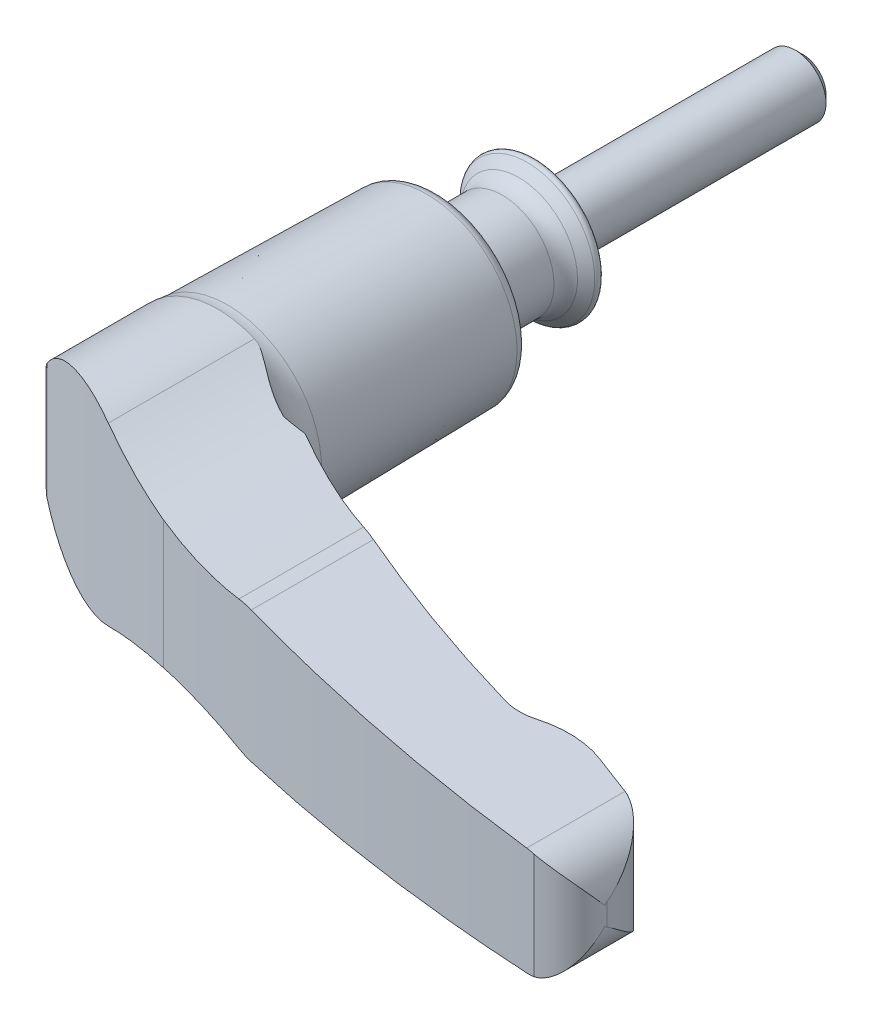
ISO-10303-21;
HEADER;
FILE_DESCRIPTION(('STEP AP214'),'2;1');
FILE_NAME('part.step','',(''),(''),'','','');
FILE_SCHEMA(('AUTOMOTIVE_DESIGN { 1 0 10303 214 1 1 1 1 }'));
ENDSEC;
DATA;
#1=APPLICATION_CONTEXT('core data for automotive mechanical design processes');
#2=APPLICATION_PROTOCOL_DEFINITION('international standard','automotive_design',2000,#1);
#3=PRODUCT_CONTEXT('',#1,'mechanical');
#4=PRODUCT('Part','Part','',(#3));
#5=PRODUCT_RELATED_PRODUCT_CATEGORY('part','',(#4));
#6=PRODUCT_DEFINITION_FORMATION('','',#4);
#7=PRODUCT_DEFINITION_CONTEXT('part definition',#1,'design');
#8=PRODUCT_DEFINITION('design','',#6,#7);
#9=PRODUCT_DEFINITION_SHAPE('','',#8);
#10=(LENGTH_UNIT() NAMED_UNIT(*) SI_UNIT(.MILLI.,.METRE.));
#11=(NAMED_UNIT(*) PLANE_ANGLE_UNIT() SI_UNIT($,.RADIAN.));
#12=(NAMED_UNIT(*) SI_UNIT($,.STERADIAN.) SOLID_ANGLE_UNIT());
#13=UNCERTAINTY_MEASURE_WITH_UNIT(LENGTH_MEASURE(1.E-05),#10,'distance_accuracy_value','');
#14=(GEOMETRIC_REPRESENTATION_CONTEXT(3) GLOBAL_UNCERTAINTY_ASSIGNED_CONTEXT((#13)) GLOBAL_UNIT_ASSIGNED_CONTEXT((#10,
#11,#12)) REPRESENTATION_CONTEXT('',''));
#15=CARTESIAN_POINT('',(0.,0.,0.));
#16=DIRECTION('',(0.,0.,1.));
#17=DIRECTION('',(1.,0.,0.));
#18=AXIS2_PLACEMENT_3D('',#15,#16,#17);
#19=CARTESIAN_POINT('',(-12.2494442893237,-13.45,40.2250875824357));
#20=DIRECTION('',(0.,0.,1.));
#21=DIRECTION('',(-1.,0.,0.));
#22=AXIS2_PLACEMENT_3D('',#19,#20,#21);
#23=PLANE('',#22);
#24=DIRECTION('',(0.,1.,0.));
#25=VECTOR('',#24,1.);
#26=CARTESIAN_POINT('',(-12.2494442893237,-13.45,40.2250875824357));
#27=LINE('',#26,#25);
#28=CARTESIAN_POINT('',(-12.2494442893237,-1.12726551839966,40.2250875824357));
#29=VERTEX_POINT('',#28);
#30=CARTESIAN_POINT('',(-12.2494442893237,0.,40.2250875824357));
#31=VERTEX_POINT('',#30);
#32=EDGE_CURVE('E175',#29,#31,#27,.T.);
#33=ORIENTED_EDGE('',*,*,#32,.T.);
#34=CARTESIAN_POINT('',(-1.62642046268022E-13,0.,40.2250875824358));
#35=DIRECTION('',(0.,0.,1.));
#36=DIRECTION('',(-1.,0.,0.));
#37=AXIS2_PLACEMENT_3D('',#34,#35,#36);
#38=CIRCLE('',#37,12.2494442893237);
#39=EDGE_CURVE('E178',#31,#31,#38,.F.);
#40=ORIENTED_EDGE('',*,*,#39,.F.);
#41=CARTESIAN_POINT('',(-12.2494442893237,1.12726551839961,40.2250875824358));
#42=VERTEX_POINT('',#41);
#43=EDGE_CURVE('E185',#31,#42,#27,.T.);
#44=ORIENTED_EDGE('',*,*,#43,.T.);
#45=CARTESIAN_POINT('',(0.,0.,40.2250875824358));
#46=DIRECTION('',(0.,0.,-1.));
#47=DIRECTION('',(1.,0.,0.));
#48=AXIS2_PLACEMENT_3D('',#45,#46,#47);
#49=CIRCLE('',#48,12.3012037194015);
#50=EDGE_CURVE('E180',#42,#29,#49,.T.);
#51=ORIENTED_EDGE('',*,*,#50,.T.);
#52=EDGE_LOOP('',(#33,#40,#44,#51));
#53=FACE_BOUND('',#52,.T.);
#54=ADVANCED_FACE('F14',(#53),#23,.F.);
#55=CARTESIAN_POINT('',(-12.3990914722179,-13.45,48.8947231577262));
#56=DIRECTION('',(0.999851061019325,0.,0.0172584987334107));
#57=DIRECTION('',(-0.0172584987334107,0.,0.999851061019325));
#58=AXIS2_PLACEMENT_3D('',#55,#56,#57);
#59=PLANE('',#58);
#60=ORIENTED_EDGE('',*,*,#43,.F.);
#61=ORIENTED_EDGE('',*,*,#32,.F.);
#62=CARTESIAN_POINT('',(-12.2494408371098,-1.12726105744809,40.2248875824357));
#63=CARTESIAN_POINT('',(-12.2501546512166,-1.12801102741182,40.2662415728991));
#64=CARTESIAN_POINT('',(-12.2508608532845,-1.13338949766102,40.3071545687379));
#65=CARTESIAN_POINT('',(-12.2522296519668,-1.15131266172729,40.3864543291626));
#66=CARTESIAN_POINT('',(-12.2528928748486,-1.16369170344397,40.4248773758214));
#67=CARTESIAN_POINT('',(-12.254538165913,-1.20206398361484,40.520195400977));
#68=CARTESIAN_POINT('',(-12.255493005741,-1.23180007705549,40.575512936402));
#69=CARTESIAN_POINT('',(-12.257344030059,-1.29909643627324,40.6827498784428));
#70=CARTESIAN_POINT('',(-12.2582382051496,-1.33683049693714,40.7345528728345));
#71=CARTESIAN_POINT('',(-12.2604895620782,-1.44052319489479,40.8649826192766));
#72=CARTESIAN_POINT('',(-12.2618006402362,-1.50977612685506,40.9409384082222));
#73=CARTESIAN_POINT('',(-12.264338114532,-1.65349391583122,41.0879440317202));
#74=CARTESIAN_POINT('',(-12.2655642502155,-1.72797350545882,41.1589787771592));
#75=CARTESIAN_POINT('',(-12.2678450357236,-1.87254522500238,41.2911134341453));
#76=CARTESIAN_POINT('',(-12.268904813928,-1.94236687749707,41.3525104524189));
#77=CARTESIAN_POINT('',(-12.2709847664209,-2.08326818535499,41.4730100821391));
#78=CARTESIAN_POINT('',(-12.2720051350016,-2.15433817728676,41.5321239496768));
#79=CARTESIAN_POINT('',(-12.2730148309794,-2.22587171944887,41.5906195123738));
#80=B_SPLINE_CURVE_WITH_KNOTS('',3,(#62,#63,#64,#65,#66,#67,#68,#69,#70,#71,#72,#73,#74,#75,#76,
#77,#78,#79),.UNSPECIFIED.,.F.,.F.,(4,2,2,2,2,2,2,2,4),(0.,0.123330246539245,0.243857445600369,
0.431247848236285,0.623227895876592,0.931023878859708,1.23972530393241,1.51862793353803,
1.79591047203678),.UNSPECIFIED.);
#81=CARTESIAN_POINT('',(-12.271249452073,-2.10212675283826,41.4883443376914));
#82=VERTEX_POINT('',#81);
#83=EDGE_CURVE('E399',#29,#82,#80,.T.);
#84=ORIENTED_EDGE('',*,*,#83,.T.);
#85=CARTESIAN_POINT('',(0.,0.,-669.432227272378));
#86=DIRECTION('',(0.999851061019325,0.,0.0172584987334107));
#87=DIRECTION('',(0.0172584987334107,0.,-0.999851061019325));
#88=AXIS2_PLACEMENT_3D('',#85,#86,#87);
#89=ELLIPSE('',#88,721.383718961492,12.45);
#90=CARTESIAN_POINT('',(-12.3990914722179,-1.12473581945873,48.8947231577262));
#91=VERTEX_POINT('',#90);
#92=EDGE_CURVE('E239',#82,#91,#89,.F.);
#93=ORIENTED_EDGE('',*,*,#92,.T.);
#94=DIRECTION('',(0.,1.,0.));
#95=VECTOR('',#94,1.);
#96=CARTESIAN_POINT('',(-12.3990914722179,-13.45,48.8947231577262));
#97=LINE('',#96,#95);
#98=CARTESIAN_POINT('',(-12.3990914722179,1.12473581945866,48.8947231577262));
#99=VERTEX_POINT('',#98);
#100=EDGE_CURVE('E184',#91,#99,#97,.T.);
#101=ORIENTED_EDGE('',*,*,#100,.T.);
#102=CARTESIAN_POINT('',(0.,0.,-669.432227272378));
#103=DIRECTION('',(0.999851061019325,0.,0.0172584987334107));
#104=DIRECTION('',(0.0172584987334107,0.,-0.999851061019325));
#105=AXIS2_PLACEMENT_3D('',#102,#103,#104);
#106=ELLIPSE('',#105,721.383718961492,12.45);
#107=CARTESIAN_POINT('',(-12.271249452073,2.10212675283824,41.4883443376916));
#108=VERTEX_POINT('',#107);
#109=EDGE_CURVE('E263',#99,#108,#106,.F.);
#110=ORIENTED_EDGE('',*,*,#109,.T.);
#111=CARTESIAN_POINT('',(-12.2730148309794,2.2258717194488,41.5906195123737));
#112=CARTESIAN_POINT('',(-12.2723484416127,2.17857656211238,41.5520130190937));
#113=CARTESIAN_POINT('',(-12.2716768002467,2.13153645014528,41.5131022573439));
#114=CARTESIAN_POINT('',(-12.2703199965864,2.03804940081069,41.4344974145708));
#115=CARTESIAN_POINT('',(-12.269634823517,1.99160298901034,41.3948027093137));
#116=CARTESIAN_POINT('',(-12.2675030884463,1.84986894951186,41.2713031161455));
#117=CARTESIAN_POINT('',(-12.2660309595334,1.75583214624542,41.1860170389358));
#118=CARTESIAN_POINT('',(-12.2637374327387,1.61936868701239,41.0531442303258));
#119=CARTESIAN_POINT('',(-12.2629577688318,1.574598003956,41.0079753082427));
#120=CARTESIAN_POINT('',(-12.2613598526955,1.48744881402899,40.9154018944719));
#121=CARTESIAN_POINT('',(-12.2605416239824,1.44506888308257,40.8679987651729));
#122=CARTESIAN_POINT('',(-12.2588634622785,1.36463549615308,40.7707764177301));
#123=CARTESIAN_POINT('',(-12.2580043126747,1.32652790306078,40.7210025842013));
#124=CARTESIAN_POINT('',(-12.2562147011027,1.25655247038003,40.6173235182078));
#125=CARTESIAN_POINT('',(-12.2552845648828,1.22465826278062,40.5634371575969));
#126=CARTESIAN_POINT('',(-12.2536883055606,1.18138793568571,40.4709597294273));
#127=CARTESIAN_POINT('',(-12.2530490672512,1.16676743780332,40.4339262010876));
#128=CARTESIAN_POINT('',(-12.2517389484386,1.14385333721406,40.3580259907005));
#129=CARTESIAN_POINT('',(-12.251068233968,1.13552979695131,40.3191689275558));
#130=CARTESIAN_POINT('',(-12.2500751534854,1.12891545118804,40.2616359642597));
#131=CARTESIAN_POINT('',(-12.2497582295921,1.12764004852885,40.2432753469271));
#132=CARTESIAN_POINT('',(-12.2494408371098,1.12726105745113,40.2248875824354));
#133=B_SPLINE_CURVE_WITH_KNOTS('',3,(#111,#112,#113,#114,#115,#116,#117,#118,#119,#120,#121,
#122,#123,#124,#125,#126,#127,#128,#129,#130,#131,#132),.UNSPECIFIED.,.F.,.F.,(4,2,2,2,2,2,2,2,
2,2,4),(0.,0.183152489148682,0.366457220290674,0.747103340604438,0.937859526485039,
1.12850085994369,1.31635856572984,1.50340080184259,1.62247471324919,1.74097889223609,
1.79613687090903),.UNSPECIFIED.);
#134=EDGE_CURVE('E190',#108,#42,#133,.T.);
#135=ORIENTED_EDGE('',*,*,#134,.T.);
#136=EDGE_LOOP('',(#60,#61,#84,#93,#101,#110,#135));
#137=FACE_BOUND('',#136,.T.);
#138=ADVANCED_FACE('F188',(#137),#59,.F.);
#139=CARTESIAN_POINT('',(111.767919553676,-13.45,-139.797819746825));
#140=DIRECTION('',(0.,1.,0.));
#141=DIRECTION('',(-1.,0.,0.));
#142=AXIS2_PLACEMENT_3D('',#139,#140,#141);
#143=CYLINDRICAL_SURFACE('',#142,208.999999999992);
#144=DIRECTION('',(0.,1.,0.));
#145=VECTOR('',#144,1.);
#146=CARTESIAN_POINT('',(15.7999999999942,-13.45,45.8662812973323));
#147=LINE('',#146,#145);
#148=CARTESIAN_POINT('',(15.8,-8.43613014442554,45.8662812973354));
#149=VERTEX_POINT('',#148);
#150=CARTESIAN_POINT('',(15.8,0.,45.8662812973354));
#151=VERTEX_POINT('',#150);
#152=EDGE_CURVE('E191',#149,#151,#147,.T.);
#153=ORIENTED_EDGE('',*,*,#152,.T.);
#154=DIRECTION('',(0.,1.,0.));
#155=VECTOR('',#154,1.);
#156=CARTESIAN_POINT('',(15.8,-13.45,45.8662812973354));
#157=LINE('',#156,#155);
#158=CARTESIAN_POINT('',(15.7999999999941,8.43613014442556,45.8662812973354));
#159=VERTEX_POINT('',#158);
#160=EDGE_CURVE('E413',#159,#151,#157,.F.);
#161=ORIENTED_EDGE('',*,*,#160,.F.);
#162=CARTESIAN_POINT('',(15.7999999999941,8.43613014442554,45.8662812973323));
#163=CARTESIAN_POINT('',(16.3870365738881,8.34717375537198,46.1697176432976));
#164=CARTESIAN_POINT('',(16.9767713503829,8.26904045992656,46.4710139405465));
#165=CARTESIAN_POINT('',(18.161091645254,8.13475115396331,47.0689822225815));
#166=CARTESIAN_POINT('',(18.7556773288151,8.07859589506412,47.3656540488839));
#167=CARTESIAN_POINT('',(20.5395968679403,7.94407204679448,48.2451118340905));
#168=CARTESIAN_POINT('',(21.7352391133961,7.89871013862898,48.8205177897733));
#169=CARTESIAN_POINT('',(24.1374209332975,7.89893976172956,49.9484747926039));
#170=CARTESIAN_POINT('',(25.3439611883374,7.94453701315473,50.5010244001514));
#171=CARTESIAN_POINT('',(27.1599173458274,8.0830634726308,51.3119106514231));
#172=CARTESIAN_POINT('',(27.7678474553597,8.14117035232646,51.5798888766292));
#173=CARTESIAN_POINT('',(28.9839481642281,8.28117670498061,52.1090693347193));
#174=CARTESIAN_POINT('',(29.5921187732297,8.36307725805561,52.370271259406));
#175=CARTESIAN_POINT('',(30.2000000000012,8.45699782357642,52.6279438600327));
#176=B_SPLINE_CURVE_WITH_KNOTS('',3,(#162,#163,#164,#165,#166,#167,#168,#169,#170,#171,#172,
#173,#174,#175),.UNSPECIFIED.,.F.,.F.,(4,2,2,2,2,2,4),(0.,2.00016069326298,4.00038978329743,
7.97994863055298,11.9597577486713,13.9600808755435,15.9604948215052),.UNSPECIFIED.);
#177=CARTESIAN_POINT('',(30.2000000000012,8.45699782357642,52.6279438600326));
#178=VERTEX_POINT('',#177);
#179=EDGE_CURVE('E264',#159,#178,#176,.T.);
#180=ORIENTED_EDGE('',*,*,#179,.T.);
#181=CARTESIAN_POINT('',(32.4002231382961,8.59297245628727,53.5458348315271));
#182=CARTESIAN_POINT('',(32.2157966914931,8.59945246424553,53.4701291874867));
#183=CARTESIAN_POINT('',(32.0313583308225,8.60144694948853,53.3941076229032));
#184=CARTESIAN_POINT('',(31.6631700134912,8.59650662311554,53.2417318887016));
#185=CARTESIAN_POINT('',(31.4794194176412,8.58958963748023,53.1653786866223));
#186=CARTESIAN_POINT('',(30.9288846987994,8.55552869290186,52.9356990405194));
#187=CARTESIAN_POINT('',(30.5630943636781,8.51506518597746,52.7818661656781));
#188=CARTESIAN_POINT('',(30.2000000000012,8.45699782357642,52.6279438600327));
#189=B_SPLINE_CURVE_WITH_KNOTS('',3,(#181,#182,#183,#184,#185,#186,#187,#188),.UNSPECIFIED.,.F.,
.F.,(4,2,2,4),(0.,0.598316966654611,1.19543895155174,2.3905773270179),.UNSPECIFIED.);
#190=CARTESIAN_POINT('',(32.4002231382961,8.59297245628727,53.5458348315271));
#191=VERTEX_POINT('',#190);
#192=EDGE_CURVE('E342',#191,#178,#189,.T.);
#193=ORIENTED_EDGE('',*,*,#192,.F.);
#194=CARTESIAN_POINT('',(111.767919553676,5.80486876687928,-139.797819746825));
#195=DIRECTION('',(-0.0351072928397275,-0.999383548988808,0.));
#196=DIRECTION('',(-0.999383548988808,0.0351072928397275,0.));
#197=AXIS2_PLACEMENT_3D('',#194,#195,#196);
#198=ELLIPSE('',#197,209.128917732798,208.999999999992);
#199=CARTESIAN_POINT('',(58.4999999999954,7.67611474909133,62.2999999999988));
#200=VERTEX_POINT('',#199);
#201=EDGE_CURVE('E350',#200,#191,#198,.T.);
#202=ORIENTED_EDGE('',*,*,#201,.F.);
#203=DIRECTION('',(0.,1.,0.));
#204=VECTOR('',#203,1.);
#205=CARTESIAN_POINT('',(58.4999999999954,-13.45,62.2999999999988));
#206=LINE('',#205,#204);
#207=CARTESIAN_POINT('',(58.4999999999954,-7.67611474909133,62.2999999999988));
#208=VERTEX_POINT('',#207);
#209=EDGE_CURVE('E193',#208,#200,#206,.T.);
#210=ORIENTED_EDGE('',*,*,#209,.F.);
#211=CARTESIAN_POINT('',(111.767919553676,-5.80486876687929,-139.797819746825));
#212=DIRECTION('',(-0.0351072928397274,0.999383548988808,0.));
#213=DIRECTION('',(0.999383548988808,0.0351072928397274,0.));
#214=AXIS2_PLACEMENT_3D('',#211,#212,#213);
#215=ELLIPSE('',#214,209.128917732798,208.999999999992);
#216=CARTESIAN_POINT('',(32.4002231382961,-8.59297245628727,53.5458348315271));
#217=VERTEX_POINT('',#216);
#218=EDGE_CURVE('E817',#217,#208,#215,.T.);
#219=ORIENTED_EDGE('',*,*,#218,.F.);
#220=CARTESIAN_POINT('',(30.2000000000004,-8.45699782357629,52.6279438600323));
#221=CARTESIAN_POINT('',(30.5630943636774,-8.51506518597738,52.7818661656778));
#222=CARTESIAN_POINT('',(30.9288846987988,-8.55552869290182,52.9356990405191));
#223=CARTESIAN_POINT('',(31.4794194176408,-8.58958963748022,53.1653786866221));
#224=CARTESIAN_POINT('',(31.6631700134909,-8.59650662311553,53.2417318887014));
#225=CARTESIAN_POINT('',(32.0313583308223,-8.60144694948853,53.3941076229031));
#226=CARTESIAN_POINT('',(32.215796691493,-8.59945246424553,53.4701291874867));
#227=CARTESIAN_POINT('',(32.4002231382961,-8.59297245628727,53.5458348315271));
#228=B_SPLINE_CURVE_WITH_KNOTS('',3,(#220,#221,#222,#223,#224,#225,#226,#227),.UNSPECIFIED.,.F.,
.F.,(4,2,2,4),(0.,1.19513837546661,1.79226036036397,2.39057732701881),.UNSPECIFIED.);
#229=CARTESIAN_POINT('',(30.2000000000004,-8.45699782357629,52.6279438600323));
#230=VERTEX_POINT('',#229);
#231=EDGE_CURVE('E317',#230,#217,#228,.T.);
#232=ORIENTED_EDGE('',*,*,#231,.F.);
#233=CARTESIAN_POINT('',(30.2,-8.45699782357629,52.6279438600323));
#234=CARTESIAN_POINT('',(29.5921187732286,-8.36307725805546,52.3702712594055));
#235=CARTESIAN_POINT('',(28.983948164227,-8.28117670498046,52.1090693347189));
#236=CARTESIAN_POINT('',(27.7678474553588,-8.14117035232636,51.5798888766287));
#237=CARTESIAN_POINT('',(27.1599173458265,-8.08306347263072,51.3119106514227));
#238=CARTESIAN_POINT('',(25.3439611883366,-7.94453701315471,50.5010244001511));
#239=CARTESIAN_POINT('',(24.1374209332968,-7.89893976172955,49.9484747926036));
#240=CARTESIAN_POINT('',(21.7352391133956,-7.89871013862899,48.820517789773));
#241=CARTESIAN_POINT('',(20.5395968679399,-7.9440720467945,48.2451118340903));
#242=CARTESIAN_POINT('',(18.7556773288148,-8.07859589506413,47.3656540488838));
#243=CARTESIAN_POINT('',(18.1610916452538,-8.13475115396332,47.0689822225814));
#244=CARTESIAN_POINT('',(16.9767713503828,-8.26904045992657,46.4710139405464));
#245=CARTESIAN_POINT('',(16.387036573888,-8.34717375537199,46.1697176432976));
#246=CARTESIAN_POINT('',(15.7999999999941,-8.43613014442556,45.8662812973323));
#247=B_SPLINE_CURVE_WITH_KNOTS('',3,(#233,#234,#235,#236,#237,#238,#239,#240,#241,#242,#243,
#244,#245,#246),.UNSPECIFIED.,.F.,.F.,(4,2,2,2,2,2,4),(0.,2.00041394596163,4.00073707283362,
7.98054619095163,11.9601050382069,13.9603341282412,15.960494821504),.UNSPECIFIED.);
#248=EDGE_CURVE('E335',#230,#149,#247,.T.);
#249=ORIENTED_EDGE('',*,*,#248,.T.);
#250=EDGE_LOOP('',(#153,#161,#180,#193,#202,#210,#219,#232,#249));
#251=FACE_BOUND('',#250,.T.);
#252=ADVANCED_FACE('F325',(#251),#143,.F.);
#253=CARTESIAN_POINT('',(76.9,-13.45,77.));
#254=DIRECTION('',(0.,0.,-1.));
#255=DIRECTION('',(0.,1.,0.));
#256=AXIS2_PLACEMENT_3D('',#253,#254,#255);
#257=PLANE('',#256);
#258=DIRECTION('',(0.,1.,0.));
#259=VECTOR('',#258,1.);
#260=CARTESIAN_POINT('',(76.9,-13.45,77.));
#261=LINE('',#260,#259);
#262=CARTESIAN_POINT('',(76.9,-6.92676825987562,77.));
#263=VERTEX_POINT('',#262);
#264=CARTESIAN_POINT('',(76.9,6.92676825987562,77.));
#265=VERTEX_POINT('',#264);
#266=EDGE_CURVE('E790',#263,#265,#261,.T.);
#267=ORIENTED_EDGE('',*,*,#266,.T.);
#268=CARTESIAN_POINT('',(75.6,1.17177043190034,77.));
#269=DIRECTION('',(0.,0.,-1.));
#270=DIRECTION('',(0.,1.,0.));
#271=AXIS2_PLACEMENT_3D('',#268,#269,#270);
#272=CIRCLE('',#271,5.9);
#273=CARTESIAN_POINT('',(76.8,6.94844767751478,77.));
#274=VERTEX_POINT('',#273);
#275=EDGE_CURVE('E860',#265,#274,#272,.F.);
#276=ORIENTED_EDGE('',*,*,#275,.T.);
#277=DIRECTION('',(0.,1.,0.));
#278=VECTOR('',#277,1.);
#279=CARTESIAN_POINT('',(76.8,-13.45,77.));
#280=LINE('',#279,#278);
#281=CARTESIAN_POINT('',(76.8,-6.94844767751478,77.));
#282=VERTEX_POINT('',#281);
#283=EDGE_CURVE('E788',#282,#274,#280,.T.);
#284=ORIENTED_EDGE('',*,*,#283,.F.);
#285=CARTESIAN_POINT('',(75.6,-1.17177043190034,77.));
#286=DIRECTION('',(0.,0.,-1.));
#287=DIRECTION('',(0.,1.,0.));
#288=AXIS2_PLACEMENT_3D('',#285,#286,#287);
#289=CIRCLE('',#288,5.9);
#290=EDGE_CURVE('E903',#282,#263,#289,.F.);
#291=ORIENTED_EDGE('',*,*,#290,.T.);
#292=EDGE_LOOP('',(#267,#276,#284,#291));
#293=FACE_BOUND('',#292,.T.);
#294=ADVANCED_FACE('F329',(#293),#257,.F.);
#295=CARTESIAN_POINT('',(99.3774025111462,-13.45,-191.753327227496));
#296=DIRECTION('',(0.,1.,0.));
#297=DIRECTION('',(-1.,0.,0.));
#298=AXIS2_PLACEMENT_3D('',#295,#296,#297);
#299=CYLINDRICAL_SURFACE('',#298,269.7);
#300=CARTESIAN_POINT('',(16.1999999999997,8.37725139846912,64.8));
#301=CARTESIAN_POINT('',(16.7767031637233,8.29486390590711,64.9869756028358));
#302=CARTESIAN_POINT('',(17.3553557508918,8.22300064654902,65.1724296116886));
#303=CARTESIAN_POINT('',(18.5159500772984,8.10050516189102,65.5400576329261));
#304=CARTESIAN_POINT('',(19.0978918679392,8.04987326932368,65.7222315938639));
#305=CARTESIAN_POINT('',(20.8414876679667,7.93052773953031,66.2615450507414));
#306=CARTESIAN_POINT('',(22.0070770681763,7.89348273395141,66.6134754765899));
#307=CARTESIAN_POINT('',(24.3425845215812,7.90540743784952,67.3013928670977));
#308=CARTESIAN_POINT('',(25.512502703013,7.95437971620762,67.6373793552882));
#309=CARTESIAN_POINT('',(27.2687809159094,8.09314767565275,68.1289718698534));
#310=CARTESIAN_POINT('',(27.8560018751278,8.15052863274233,68.2911856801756));
#311=CARTESIAN_POINT('',(29.0291528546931,8.28726693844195,68.611001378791));
#312=CARTESIAN_POINT('',(29.6150828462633,8.36662477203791,68.7686031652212));
#313=CARTESIAN_POINT('',(30.2000000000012,8.45699782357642,68.9238236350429));
#314=B_SPLINE_CURVE_WITH_KNOTS('',3,(#300,#301,#302,#303,#304,#305,#306,#307,#308,#309,#310,
#311,#312,#313),.UNSPECIFIED.,.F.,.F.,(4,2,2,2,2,2,4),(0.,1.83529834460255,3.6706254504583,
7.32170279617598,10.9728891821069,12.808257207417,14.6436657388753),.UNSPECIFIED.);
#315=CARTESIAN_POINT('',(16.1999999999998,8.37725139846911,64.8));
#316=VERTEX_POINT('',#315);
#317=CARTESIAN_POINT('',(30.2000000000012,8.45699782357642,68.9238236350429));
#318=VERTEX_POINT('',#317);
#319=EDGE_CURVE('E775',#316,#318,#314,.T.);
#320=ORIENTED_EDGE('',*,*,#319,.F.);
#321=DIRECTION('',(0.,1.,0.));
#322=VECTOR('',#321,1.);
#323=CARTESIAN_POINT('',(16.1999999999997,-13.45,64.8));
#324=LINE('',#323,#322);
#325=CARTESIAN_POINT('',(16.1999999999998,-8.37725139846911,64.8));
#326=VERTEX_POINT('',#325);
#327=EDGE_CURVE('E349',#326,#316,#324,.T.);
#328=ORIENTED_EDGE('',*,*,#327,.F.);
#329=CARTESIAN_POINT('',(30.2,-8.45699782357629,68.9238236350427));
#330=CARTESIAN_POINT('',(29.6150828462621,-8.36662477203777,68.7686031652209));
#331=CARTESIAN_POINT('',(29.029152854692,-8.28726693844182,68.6110013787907));
#332=CARTESIAN_POINT('',(27.8560018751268,-8.15052863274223,68.2911856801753));
#333=CARTESIAN_POINT('',(27.2687809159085,-8.09314767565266,68.1289718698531));
#334=CARTESIAN_POINT('',(25.5125027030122,-7.95437971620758,67.637379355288));
#335=CARTESIAN_POINT('',(24.3425845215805,-7.9054074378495,67.3013928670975));
#336=CARTESIAN_POINT('',(22.0070770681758,-7.89348273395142,66.6134754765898));
#337=CARTESIAN_POINT('',(20.8414876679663,-7.93052773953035,66.2615450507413));
#338=CARTESIAN_POINT('',(19.097891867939,-8.0498732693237,65.7222315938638));
#339=CARTESIAN_POINT('',(18.5159500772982,-8.10050516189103,65.540057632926));
#340=CARTESIAN_POINT('',(17.3553557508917,-8.22300064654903,65.1724296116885));
#341=CARTESIAN_POINT('',(16.7767031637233,-8.29486390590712,64.9869756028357));
#342=CARTESIAN_POINT('',(16.1999999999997,-8.37725139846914,64.8));
#343=B_SPLINE_CURVE_WITH_KNOTS('',3,(#329,#330,#331,#332,#333,#334,#335,#336,#337,#338,#339,
#340,#341,#342),.UNSPECIFIED.,.F.,.F.,(4,2,2,2,2,2,4),(0.,1.83540853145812,3.67077655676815,
7.32196294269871,10.9730402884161,12.8083673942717,14.6436657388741),.UNSPECIFIED.);
#344=CARTESIAN_POINT('',(30.2000000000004,-8.45699782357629,68.9238236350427));
#345=VERTEX_POINT('',#344);
#346=EDGE_CURVE('E446',#345,#326,#343,.T.);
#347=ORIENTED_EDGE('',*,*,#346,.F.);
#348=CARTESIAN_POINT('',(30.2000000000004,-8.45699782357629,68.9238236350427));
#349=CARTESIAN_POINT('',(30.5632894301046,-8.51510955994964,69.0202386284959));
#350=CARTESIAN_POINT('',(30.9292671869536,-8.55556829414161,69.1165394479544));
#351=CARTESIAN_POINT('',(31.4798508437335,-8.58960835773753,69.2601745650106));
#352=CARTESIAN_POINT('',(31.6635722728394,-8.5965163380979,69.3078974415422));
#353=CARTESIAN_POINT('',(32.0316308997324,-8.60144626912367,69.4030885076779));
#354=CARTESIAN_POINT('',(32.21596856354,-8.59944866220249,69.4505559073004));
#355=CARTESIAN_POINT('',(32.4002231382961,-8.59297245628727,69.4977922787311));
#356=B_SPLINE_CURVE_WITH_KNOTS('',3,(#348,#349,#350,#351,#352,#353,#354,#355),.UNSPECIFIED.,.F.,
.F.,(4,2,2,4),(0.,1.14021168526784,1.70984874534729,2.2807374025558),.UNSPECIFIED.);
#357=CARTESIAN_POINT('',(32.4002231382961,-8.59297245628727,69.497792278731));
#358=VERTEX_POINT('',#357);
#359=EDGE_CURVE('E292',#345,#358,#356,.T.);
#360=ORIENTED_EDGE('',*,*,#359,.T.);
#361=CARTESIAN_POINT('',(99.3774025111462,-6.24013459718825,-191.753327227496));
#362=DIRECTION('',(-0.0351072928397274,0.999383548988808,0.));
#363=DIRECTION('',(0.999383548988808,0.0351072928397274,0.));
#364=AXIS2_PLACEMENT_3D('',#361,#362,#363);
#365=ELLIPSE('',#364,269.866359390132,269.7);
#366=CARTESIAN_POINT('',(75.8071330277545,-7.06813337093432,76.9147438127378));
#367=VERTEX_POINT('',#366);
#368=EDGE_CURVE('E304',#358,#367,#365,.T.);
#369=ORIENTED_EDGE('',*,*,#368,.T.);
#370=CARTESIAN_POINT('',(75.8071330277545,-7.06813337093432,76.9147438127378));
#371=CARTESIAN_POINT('',(75.9742663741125,-7.06223993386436,76.929403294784));
#372=CARTESIAN_POINT('',(76.1405719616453,-7.04931940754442,76.943837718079));
#373=CARTESIAN_POINT('',(76.4715276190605,-7.00942417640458,76.9722564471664));
#374=CARTESIAN_POINT('',(76.6361776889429,-6.98244947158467,76.9862407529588));
#375=CARTESIAN_POINT('',(76.8,-6.94844767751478,77.));
#376=B_SPLINE_CURVE_WITH_KNOTS('',3,(#370,#371,#372,#373,#374,#375),.UNSPECIFIED.,.F.,.F.,(4,2,
4),(0.,0.50229032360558,1.00458064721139),.UNSPECIFIED.);
#377=EDGE_CURVE('E905',#367,#282,#376,.T.);
#378=ORIENTED_EDGE('',*,*,#377,.T.);
#379=ORIENTED_EDGE('',*,*,#283,.T.);
#380=CARTESIAN_POINT('',(76.8,6.94844767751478,77.));
#381=CARTESIAN_POINT('',(76.6361776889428,6.98244947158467,76.9862407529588));
#382=CARTESIAN_POINT('',(76.4715276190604,7.00942417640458,76.9722564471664));
#383=CARTESIAN_POINT('',(76.1405719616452,7.04931940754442,76.943837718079));
#384=CARTESIAN_POINT('',(75.9742663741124,7.06223993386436,76.929403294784));
#385=CARTESIAN_POINT('',(75.8071330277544,7.06813337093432,76.9147438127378));
#386=B_SPLINE_CURVE_WITH_KNOTS('',3,(#380,#381,#382,#383,#384,#385),.UNSPECIFIED.,.F.,.F.,(4,2,
4),(0.,0.502290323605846,1.00458064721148),.UNSPECIFIED.);
#387=CARTESIAN_POINT('',(75.8071330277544,7.06813337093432,76.9147438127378));
#388=VERTEX_POINT('',#387);
#389=EDGE_CURVE('E847',#274,#388,#386,.T.);
#390=ORIENTED_EDGE('',*,*,#389,.T.);
#391=CARTESIAN_POINT('',(99.3774025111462,6.24013459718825,-191.753327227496));
#392=DIRECTION('',(-0.0351072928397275,-0.999383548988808,0.));
#393=DIRECTION('',(-0.999383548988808,0.0351072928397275,0.));
#394=AXIS2_PLACEMENT_3D('',#391,#392,#393);
#395=ELLIPSE('',#394,269.866359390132,269.7);
#396=CARTESIAN_POINT('',(32.4002231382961,8.59297245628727,69.497792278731));
#397=VERTEX_POINT('',#396);
#398=EDGE_CURVE('E372',#388,#397,#395,.T.);
#399=ORIENTED_EDGE('',*,*,#398,.T.);
#400=CARTESIAN_POINT('',(32.4002231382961,8.59297245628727,69.497792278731));
#401=CARTESIAN_POINT('',(32.2159685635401,8.59944866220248,69.4505559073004));
#402=CARTESIAN_POINT('',(32.0316308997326,8.60144626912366,69.4030885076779));
#403=CARTESIAN_POINT('',(31.6635722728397,8.5965163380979,69.3078974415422));
#404=CARTESIAN_POINT('',(31.4798508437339,8.58960835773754,69.2601745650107));
#405=CARTESIAN_POINT('',(30.9292671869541,8.55556829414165,69.1165394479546));
#406=CARTESIAN_POINT('',(30.5632894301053,8.51510955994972,69.0202386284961));
#407=CARTESIAN_POINT('',(30.2000000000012,8.45699782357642,68.9238236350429));
#408=B_SPLINE_CURVE_WITH_KNOTS('',3,(#400,#401,#402,#403,#404,#405,#406,#407),.UNSPECIFIED.,.F.,
.F.,(4,2,2,4),(0.,0.5708886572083,1.14052571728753,2.28073740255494),.UNSPECIFIED.);
#409=EDGE_CURVE('E363',#397,#318,#408,.T.);
#410=ORIENTED_EDGE('',*,*,#409,.T.);
#411=EDGE_LOOP('',(#320,#328,#347,#360,#369,#378,#379,#390,#399,#410));
#412=FACE_BOUND('',#411,.T.);
#413=ADVANCED_FACE('F306',(#412),#299,.T.);
#414=CARTESIAN_POINT('',(79.8840849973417,-13.45,-124.78991881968));
#415=DIRECTION('',(0.,1.,0.));
#416=DIRECTION('',(-1.,0.,0.));
#417=AXIS2_PLACEMENT_3D('',#414,#415,#416);
#418=CYLINDRICAL_SURFACE('',#417,200.000000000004);
#419=DIRECTION('',(0.,1.,0.));
#420=VECTOR('',#419,1.);
#421=CARTESIAN_POINT('',(-9.90000000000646,-13.45,53.9244289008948));
#422=LINE('',#421,#420);
#423=CARTESIAN_POINT('',(-9.90000000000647,-7.54933771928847,53.9244289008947));
#424=VERTEX_POINT('',#423);
#425=CARTESIAN_POINT('',(-9.90000000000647,7.54933771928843,53.9244289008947));
#426=VERTEX_POINT('',#425);
#427=EDGE_CURVE('E199',#424,#426,#422,.T.);
#428=ORIENTED_EDGE('',*,*,#427,.F.);
#429=CARTESIAN_POINT('',(-9.90000000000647,-7.54933771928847,53.9244289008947));
#430=CARTESIAN_POINT('',(-9.67451817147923,-7.84507120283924,54.0377127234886));
#431=CARTESIAN_POINT('',(-9.4368447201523,-8.12923310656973,54.1565790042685));
#432=CARTESIAN_POINT('',(-8.93966759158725,-8.67296304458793,54.403880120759));
#433=CARTESIAN_POINT('',(-8.68017587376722,-8.93254438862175,54.5323097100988));
#434=CARTESIAN_POINT('',(-8.14219185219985,-9.42550410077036,54.7970082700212));
#435=CARTESIAN_POINT('',(-7.86373776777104,-9.65893280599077,54.9332613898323));
#436=CARTESIAN_POINT('',(-7.28965149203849,-10.0992248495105,55.2124187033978));
#437=CARTESIAN_POINT('',(-6.994017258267,-10.3060850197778,55.3553236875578));
#438=CARTESIAN_POINT('',(-6.38843577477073,-10.6920089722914,55.6461218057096));
#439=CARTESIAN_POINT('',(-6.07851806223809,-10.8711270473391,55.7940044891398));
#440=CARTESIAN_POINT('',(-5.44596700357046,-11.2013953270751,56.0937585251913));
#441=CARTESIAN_POINT('',(-5.12333306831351,-11.3525442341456,56.2456300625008));
#442=CARTESIAN_POINT('',(-4.46756903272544,-11.6262415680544,56.5521043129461));
#443=CARTESIAN_POINT('',(-4.13444284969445,-11.7488005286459,56.7067059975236));
#444=CARTESIAN_POINT('',(-3.45976822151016,-11.9648655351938,57.0175072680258));
#445=CARTESIAN_POINT('',(-3.11822142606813,-12.0583772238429,57.1737065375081));
#446=CARTESIAN_POINT('',(-2.31903314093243,-12.2409805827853,57.5364253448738));
#447=CARTESIAN_POINT('',(-1.85895294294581,-12.3192478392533,57.743179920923));
#448=CARTESIAN_POINT('',(-1.16440659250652,-12.3976193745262,58.0521070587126));
#449=CARTESIAN_POINT('',(-0.932215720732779,-12.4172382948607,58.1548548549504));
#450=CARTESIAN_POINT('',(-0.466758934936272,-12.443430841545,58.3597645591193));
#451=CARTESIAN_POINT('',(-0.233492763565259,-12.4500011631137,58.4619263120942));
#452=CARTESIAN_POINT('',(0.405450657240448,-12.4499979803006,58.7403022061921));
#453=CARTESIAN_POINT('',(0.811584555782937,-12.4301810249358,58.9156432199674));
#454=CARTESIAN_POINT('',(1.62179032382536,-12.3506318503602,59.2622685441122));
#455=CARTESIAN_POINT('',(2.02586144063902,-12.2908859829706,59.4335514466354));
#456=CARTESIAN_POINT('',(2.83079805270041,-12.1308842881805,59.7716755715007));
#457=CARTESIAN_POINT('',(3.23162970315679,-12.030387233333,59.9384839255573));
#458=CARTESIAN_POINT('',(4.02384464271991,-11.7891025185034,60.2652335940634));
#459=CARTESIAN_POINT('',(4.41522782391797,-11.6483143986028,60.4251748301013));
#460=CARTESIAN_POINT('',(4.79999999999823,-11.4874931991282,60.5810071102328));
#461=B_SPLINE_CURVE_WITH_KNOTS('',3,(#429,#430,#431,#432,#433,#434,#435,#436,#437,#438,#439,
#440,#441,#442,#443,#444,#445,#446,#447,#448,#449,#450,#451,#452,#453,#454,#455,#456,#457,#458,
#459,#460),.UNSPECIFIED.,.F.,.F.,(4,2,2,2,2,2,2,2,2,2,2,2,2,2,2,4),(0.,1.16572536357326,
2.33081586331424,3.49362387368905,4.65657040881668,5.81721142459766,6.97790627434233,
8.1381727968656,9.29821378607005,10.8264676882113,11.5901890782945,12.3541038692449,
13.6806107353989,15.007571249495,16.3425041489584,17.67745228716),.UNSPECIFIED.);
#462=CARTESIAN_POINT('',(4.79999999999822,-11.4874931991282,60.5810071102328));
#463=VERTEX_POINT('',#462);
#464=EDGE_CURVE('E202',#424,#463,#461,.T.);
#465=ORIENTED_EDGE('',*,*,#464,.T.);
#466=CARTESIAN_POINT('',(16.1999999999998,-8.37725139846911,64.8));
#467=CARTESIAN_POINT('',(15.21368787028,-8.51813618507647,64.4687294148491));
#468=CARTESIAN_POINT('',(14.2339762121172,-8.68971619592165,64.1310391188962));
#469=CARTESIAN_POINT('',(12.2943158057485,-9.09213654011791,63.4457683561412));
#470=CARTESIAN_POINT('',(11.3343097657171,-9.32276678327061,63.0982267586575));
#471=CARTESIAN_POINT('',(9.43367460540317,-9.8421618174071,62.3938598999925));
#472=CARTESIAN_POINT('',(8.49304509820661,-10.1309254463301,62.0370348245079));
#473=CARTESIAN_POINT('',(6.63069309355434,-10.7662294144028,61.3147410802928));
#474=CARTESIAN_POINT('',(5.70904885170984,-11.1129696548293,60.9492463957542));
#475=CARTESIAN_POINT('',(4.79999999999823,-11.4874931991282,60.5810071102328));
#476=B_SPLINE_CURVE_WITH_KNOTS('',3,(#466,#467,#468,#469,#470,#471,#472,#473,#474,#475),
.UNSPECIFIED.,.F.,.F.,(4,2,2,2,4),(0.,3.14928931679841,6.2875260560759,9.42570006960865,
12.5749263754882),.UNSPECIFIED.);
#477=EDGE_CURVE('E211',#326,#463,#476,.T.);
#478=ORIENTED_EDGE('',*,*,#477,.F.);
#479=ORIENTED_EDGE('',*,*,#327,.T.);
#480=CARTESIAN_POINT('',(4.7999999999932,11.4874931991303,60.5810071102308));
#481=CARTESIAN_POINT('',(5.70904885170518,11.1129696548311,60.9492463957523));
#482=CARTESIAN_POINT('',(6.63069309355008,10.7662294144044,61.3147410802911));
#483=CARTESIAN_POINT('',(8.49304509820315,10.1309254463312,62.0370348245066));
#484=CARTESIAN_POINT('',(9.43367460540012,9.84216181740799,62.3938598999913));
#485=CARTESIAN_POINT('',(11.3343097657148,9.32276678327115,63.0982267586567));
#486=CARTESIAN_POINT('',(12.2943158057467,9.0921365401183,63.4457683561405));
#487=CARTESIAN_POINT('',(14.2339762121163,8.6897161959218,64.1310391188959));
#488=CARTESIAN_POINT('',(15.2136878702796,8.51813618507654,64.4687294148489));
#489=CARTESIAN_POINT('',(16.1999999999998,8.37725139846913,64.8));
#490=B_SPLINE_CURVE_WITH_KNOTS('',3,(#480,#481,#482,#483,#484,#485,#486,#487,#488,#489),
.UNSPECIFIED.,.F.,.F.,(4,2,2,2,4),(0.,3.14922630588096,6.28740031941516,9.42563705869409,
12.574926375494),.UNSPECIFIED.);
#491=CARTESIAN_POINT('',(4.7999999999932,11.4874931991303,60.5810071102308));
#492=VERTEX_POINT('',#491);
#493=EDGE_CURVE('E293',#492,#316,#490,.T.);
#494=ORIENTED_EDGE('',*,*,#493,.F.);
#495=CARTESIAN_POINT('',(4.79999999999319,11.4874931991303,60.5810071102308));
#496=CARTESIAN_POINT('',(4.41580947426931,11.6480694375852,60.425410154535));
#497=CARTESIAN_POINT('',(4.02503382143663,11.7886738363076,60.2657194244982));
#498=CARTESIAN_POINT('',(3.23419246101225,12.0296727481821,59.9395455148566));
#499=CARTESIAN_POINT('',(2.8341300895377,12.1300814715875,59.7730647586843));
#500=CARTESIAN_POINT('',(2.02936760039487,12.2903278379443,59.4350346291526));
#501=CARTESIAN_POINT('',(1.62468227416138,12.3502704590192,59.2634995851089));
#502=CARTESIAN_POINT('',(0.8131282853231,12.4301064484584,58.9163098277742));
#503=CARTESIAN_POINT('',(0.406259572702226,12.4499988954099,58.7406550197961));
#504=CARTESIAN_POINT('',(-0.381370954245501,12.4500010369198,58.3974981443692));
#505=CARTESIAN_POINT('',(-0.762205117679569,12.432473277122,58.230155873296));
#506=CARTESIAN_POINT('',(-1.52013839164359,12.3627058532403,57.8943010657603));
#507=CARTESIAN_POINT('',(-1.89723770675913,12.310468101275,57.7257885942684));
#508=CARTESIAN_POINT('',(-2.64540716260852,12.1716555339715,57.3887062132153));
#509=CARTESIAN_POINT('',(-3.0164722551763,12.0850533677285,57.2201363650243));
#510=CARTESIAN_POINT('',(-3.74968971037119,11.8780234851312,56.884389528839));
#511=CARTESIAN_POINT('',(-4.11184217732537,11.7575961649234,56.717212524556));
#512=CARTESIAN_POINT('',(-4.82530709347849,11.4832593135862,56.3853387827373));
#513=CARTESIAN_POINT('',(-5.17659902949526,11.329290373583,56.2206470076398));
#514=CARTESIAN_POINT('',(-5.86509267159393,10.9886630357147,55.8955080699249));
#515=CARTESIAN_POINT('',(-6.20229273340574,10.8020008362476,55.7350614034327));
#516=CARTESIAN_POINT('',(-6.85929279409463,10.3971732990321,55.4202886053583));
#517=CARTESIAN_POINT('',(-7.17912282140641,10.1790648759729,55.2659520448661));
#518=CARTESIAN_POINT('',(-7.79913838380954,9.71218172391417,54.9648338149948));
#519=CARTESIAN_POINT('',(-8.09933309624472,9.46342148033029,54.8180486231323));
#520=CARTESIAN_POINT('',(-8.6621015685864,8.9502892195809,54.5412436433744));
#521=CARTESIAN_POINT('',(-8.92582503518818,8.6874365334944,54.410747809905));
#522=CARTESIAN_POINT('',(-9.43052390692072,8.13678568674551,54.1597401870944));
#523=CARTESIAN_POINT('',(-9.67151657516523,7.8490067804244,54.03922082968));
#524=CARTESIAN_POINT('',(-9.90000000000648,7.54933771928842,53.9244289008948));
#525=B_SPLINE_CURVE_WITH_KNOTS('',3,(#495,#496,#497,#498,#499,#500,#501,#502,#503,#504,#505,
#506,#507,#508,#509,#510,#511,#512,#513,#514,#515,#516,#517,#518,#519,#520,#521,#522,#523,#524),
.UNSPECIFIED.,.F.,.F.,(4,2,2,2,2,2,2,2,2,2,2,2,2,2,4),(0.,1.33291829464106,2.66536494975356,
3.99434151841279,5.32334866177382,6.5709370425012,7.81845670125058,9.06697126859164,
10.3154712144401,11.5662007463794,12.8170758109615,14.0657146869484,15.3137657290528,
16.4958742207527,17.6770775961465),.UNSPECIFIED.);
#526=EDGE_CURVE('E286',#492,#426,#525,.T.);
#527=ORIENTED_EDGE('',*,*,#526,.T.);
#528=EDGE_LOOP('',(#428,#465,#478,#479,#494,#527));
#529=FACE_BOUND('',#528,.T.);
#530=ADVANCED_FACE('F248',(#529),#418,.T.);
#531=CARTESIAN_POINT('',(-6.3,-13.45,49.0000000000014));
#532=DIRECTION('',(0.,1.,0.));
#533=DIRECTION('',(-1.,0.,0.));
#534=AXIS2_PLACEMENT_3D('',#531,#532,#533);
#535=CYLINDRICAL_SURFACE('',#534,6.1);
#536=ORIENTED_EDGE('',*,*,#427,.T.);
#537=CARTESIAN_POINT('',(-9.90000000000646,7.54933771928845,53.9244289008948));
#538=CARTESIAN_POINT('',(-10.0046272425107,7.41212768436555,53.8479316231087));
#539=CARTESIAN_POINT('',(-10.1057058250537,7.27366477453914,53.7689319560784));
#540=CARTESIAN_POINT('',(-10.3008751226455,6.99453251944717,53.6064237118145));
#541=CARTESIAN_POINT('',(-10.3949674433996,6.8538636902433,53.5229161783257));
#542=CARTESIAN_POINT('',(-10.6668294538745,6.42916605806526,53.2664803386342));
#543=CARTESIAN_POINT('',(-10.8343792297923,6.14218866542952,53.0874940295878));
#544=CARTESIAN_POINT('',(-11.1421944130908,5.56422896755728,52.7176240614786));
#545=CARTESIAN_POINT('',(-11.2826072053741,5.27327804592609,52.5268125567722));
#546=CARTESIAN_POINT('',(-11.5382549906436,4.68755769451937,52.1345668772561));
#547=CARTESIAN_POINT('',(-11.6534929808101,4.39278872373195,51.9331339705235));
#548=CARTESIAN_POINT('',(-11.822924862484,3.90661945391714,51.5940966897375));
#549=CARTESIAN_POINT('',(-11.8842552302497,3.71572911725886,51.4592618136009));
#550=CARTESIAN_POINT('',(-11.9969703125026,3.33388552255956,51.1855148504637));
#551=CARTESIAN_POINT('',(-12.0483542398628,3.14293226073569,51.0466024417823));
#552=CARTESIAN_POINT('',(-12.1260618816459,2.82462255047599,50.8102464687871));
#553=CARTESIAN_POINT('',(-12.1550800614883,2.6969298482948,50.7141297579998));
#554=CARTESIAN_POINT('',(-12.2086854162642,2.44281059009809,50.5191072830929));
#555=CARTESIAN_POINT('',(-12.2332743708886,2.31638354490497,50.420202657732));
#556=CARTESIAN_POINT('',(-12.2704776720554,2.10831497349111,50.2522334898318));
#557=CARTESIAN_POINT('',(-12.2843345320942,2.02594231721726,50.1843484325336));
#558=CARTESIAN_POINT('',(-12.3100752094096,1.86314619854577,50.0459284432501));
#559=CARTESIAN_POINT('',(-12.3219596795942,1.78272209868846,49.9753943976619));
#560=CARTESIAN_POINT('',(-12.3424058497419,1.63475623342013,49.8387611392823));
#561=CARTESIAN_POINT('',(-12.3511943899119,1.56681696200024,49.7731262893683));
#562=CARTESIAN_POINT('',(-12.3670759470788,1.43603364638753,49.6366694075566));
#563=CARTESIAN_POINT('',(-12.3741715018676,1.37318207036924,49.5658553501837));
#564=CARTESIAN_POINT('',(-12.3830656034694,1.28954286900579,49.4555496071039));
#565=CARTESIAN_POINT('',(-12.3856658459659,1.26425474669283,49.4195939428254));
#566=CARTESIAN_POINT('',(-12.3903418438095,1.21756776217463,49.3451522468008));
#567=CARTESIAN_POINT('',(-12.3924179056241,1.19616662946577,49.3066677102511));
#568=CARTESIAN_POINT('',(-12.3955976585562,1.16270888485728,49.2340076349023));
#569=CARTESIAN_POINT('',(-12.3968091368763,1.14966347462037,49.2003044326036));
#570=CARTESIAN_POINT('',(-12.3986849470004,1.12925581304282,49.1312436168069));
#571=CARTESIAN_POINT('',(-12.3993512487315,1.12187310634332,49.0958924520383));
#572=CARTESIAN_POINT('',(-12.3999734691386,1.11497561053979,49.0327446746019));
#573=CARTESIAN_POINT('',(-12.4000585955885,1.11402993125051,49.0051039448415));
#574=CARTESIAN_POINT('',(-12.3998578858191,1.11624858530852,48.9497493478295));
#575=CARTESIAN_POINT('',(-12.399568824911,1.11944864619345,48.9220369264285));
#576=CARTESIAN_POINT('',(-12.3990914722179,1.12473581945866,48.8947231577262));
#577=B_SPLINE_CURVE_WITH_KNOTS('',3,(#537,#538,#539,#540,#541,#542,#543,#544,#545,#546,#547,
#548,#549,#550,#551,#552,#553,#554,#555,#556,#557,#558,#559,#560,#561,#562,#563,#564,#565,#566,
#567,#568,#569,#570,#571,#572,#573,#574,#575,#576),.UNSPECIFIED.,.F.,.F.,(4,2,2,2,2,2,2,2,2,2,2,
2,2,2,2,2,2,2,2,4),(0.,0.566113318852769,1.13209611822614,2.26300366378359,3.38758494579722,
4.5120322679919,5.23669041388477,5.96140588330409,6.44865012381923,6.93569814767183,
7.25857007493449,7.58133490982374,7.86586699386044,8.14996984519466,8.28191970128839,
8.41379223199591,8.52191310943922,8.6296415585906,8.71230660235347,8.79568880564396),.UNSPECIFIED.);
#578=EDGE_CURVE('E254',#426,#99,#577,.T.);
#579=ORIENTED_EDGE('',*,*,#578,.T.);
#580=ORIENTED_EDGE('',*,*,#100,.F.);
#581=CARTESIAN_POINT('',(-12.3990914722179,-1.12473581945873,48.8947231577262));
#582=CARTESIAN_POINT('',(-12.3996477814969,-1.11855680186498,48.9263072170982));
#583=CARTESIAN_POINT('',(-12.3999461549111,-1.11526130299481,48.9584257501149));
#584=CARTESIAN_POINT('',(-12.4000388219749,-1.1142553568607,49.0224040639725));
#585=CARTESIAN_POINT('',(-12.3998385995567,-1.11648414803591,49.0542628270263));
#586=CARTESIAN_POINT('',(-12.398957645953,-1.12621618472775,49.1171143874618));
#587=CARTESIAN_POINT('',(-12.3982771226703,-1.13371714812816,49.1481075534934));
#588=CARTESIAN_POINT('',(-12.3965024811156,-1.152962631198,49.2087543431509));
#589=CARTESIAN_POINT('',(-12.3954074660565,-1.16471634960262,49.2384049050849));
#590=CARTESIAN_POINT('',(-12.3915693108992,-1.2050829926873,49.325952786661));
#591=CARTESIAN_POINT('',(-12.388289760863,-1.23859794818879,49.3815173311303));
#592=CARTESIAN_POINT('',(-12.3806880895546,-1.31242861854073,49.4879527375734));
#593=CARTESIAN_POINT('',(-12.376359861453,-1.35278373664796,49.5387936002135));
#594=CARTESIAN_POINT('',(-12.3663253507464,-1.44177329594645,49.6424016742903));
#595=CARTESIAN_POINT('',(-12.3605210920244,-1.49083153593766,49.6947913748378));
#596=CARTESIAN_POINT('',(-12.3479489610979,-1.59162003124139,49.7968362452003));
#597=CARTESIAN_POINT('',(-12.3411802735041,-1.64335252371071,49.8464890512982));
#598=CARTESIAN_POINT('',(-12.3194716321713,-1.80121349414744,49.9928499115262));
#599=CARTESIAN_POINT('',(-12.3031544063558,-1.90977427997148,50.0867143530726));
#600=CARTESIAN_POINT('',(-12.2669257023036,-2.13017179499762,50.2706532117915));
#601=CARTESIAN_POINT('',(-12.2469994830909,-2.24202032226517,50.3607101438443));
#602=CARTESIAN_POINT('',(-12.2036548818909,-2.46706676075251,50.5379086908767));
#603=CARTESIAN_POINT('',(-12.1802416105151,-2.58026247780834,50.6250543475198));
#604=CARTESIAN_POINT('',(-12.1164026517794,-2.86831170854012,50.843495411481));
#605=CARTESIAN_POINT('',(-12.0735859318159,-3.04368513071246,50.9734118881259));
#606=CARTESIAN_POINT('',(-11.9795791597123,-3.39488995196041,51.2295643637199));
#607=CARTESIAN_POINT('',(-11.9283877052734,-3.57072142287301,51.3557997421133));
#608=CARTESIAN_POINT('',(-11.7619352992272,-4.09821672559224,51.7298192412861));
#609=CARTESIAN_POINT('',(-11.6338805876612,-4.44949493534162,51.9726289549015));
#610=CARTESIAN_POINT('',(-11.34324189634,-5.14539140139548,52.4426131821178));
#611=CARTESIAN_POINT('',(-11.18082918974,-5.49003376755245,52.6698581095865));
#612=CARTESIAN_POINT('',(-10.8197440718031,-6.17121731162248,53.1063377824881));
#613=CARTESIAN_POINT('',(-10.6211196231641,-6.50776854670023,53.3155958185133));
#614=CARTESIAN_POINT('',(-10.3247304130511,-6.95867015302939,53.5850738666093));
#615=CARTESIAN_POINT('',(-10.2433360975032,-7.07796998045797,53.6553033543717));
#616=CARTESIAN_POINT('',(-10.075485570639,-7.31492708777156,53.7924366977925));
#617=CARTESIAN_POINT('',(-9.98902887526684,-7.43258420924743,53.8593402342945));
#618=CARTESIAN_POINT('',(-9.90000000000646,-7.54933771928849,53.9244289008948));
#619=B_SPLINE_CURVE_WITH_KNOTS('',3,(#581,#582,#583,#584,#585,#586,#587,#588,#589,#590,#591,
#592,#593,#594,#595,#596,#597,#598,#599,#600,#601,#602,#603,#604,#605,#606,#607,#608,#609,#610,
#611,#612,#613,#614,#615,#616,#617,#618),.UNSPECIFIED.,.F.,.F.,(4,2,2,2,2,2,2,2,2,2,2,2,2,2,2,2,
2,2,4),(0.,0.0963901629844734,0.191724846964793,0.287018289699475,0.382519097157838,
0.576300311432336,0.771238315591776,0.98706846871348,1.20308219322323,1.63612237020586,
2.07097291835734,2.50519231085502,3.17221143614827,3.83934236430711,5.17506750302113,
6.50428472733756,7.83175401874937,8.31342982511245,8.79515176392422),.UNSPECIFIED.);
#620=EDGE_CURVE('E230',#91,#424,#619,.T.);
#621=ORIENTED_EDGE('',*,*,#620,.T.);
#622=EDGE_LOOP('',(#536,#579,#580,#621));
#623=FACE_BOUND('',#622,.T.);
#624=ADVANCED_FACE('F243',(#623),#535,.T.);
#625=CARTESIAN_POINT('',(60.181295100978,-13.45,55.4019389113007));
#626=DIRECTION('',(0.,1.,0.));
#627=DIRECTION('',(-1.,0.,0.));
#628=AXIS2_PLACEMENT_3D('',#625,#626,#627);
#629=CYLINDRICAL_SURFACE('',#628,7.0999999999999);
#630=CARTESIAN_POINT('',(60.181295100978,7.61705262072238,55.4019389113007));
#631=DIRECTION('',(-0.0351072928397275,-0.999383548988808,0.));
#632=DIRECTION('',(-0.999383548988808,0.0351072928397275,0.));
#633=AXIS2_PLACEMENT_3D('',#630,#631,#632);
#634=ELLIPSE('',#633,7.10437950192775,7.0999999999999);
#635=CARTESIAN_POINT('',(62.4000000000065,7.53911185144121,62.1463698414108));
#636=VERTEX_POINT('',#635);
#637=EDGE_CURVE('E813',#636,#200,#634,.T.);
#638=ORIENTED_EDGE('',*,*,#637,.F.);
#639=DIRECTION('',(0.,1.,0.));
#640=VECTOR('',#639,1.);
#641=CARTESIAN_POINT('',(62.4000000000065,-13.45,62.1463698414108));
#642=LINE('',#641,#640);
#643=CARTESIAN_POINT('',(62.4000000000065,-7.53911185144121,62.1463698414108));
#644=VERTEX_POINT('',#643);
#645=EDGE_CURVE('E806',#644,#636,#642,.T.);
#646=ORIENTED_EDGE('',*,*,#645,.F.);
#647=CARTESIAN_POINT('',(60.181295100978,-7.61705262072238,55.4019389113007));
#648=DIRECTION('',(-0.0351072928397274,0.999383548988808,0.));
#649=DIRECTION('',(0.999383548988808,0.0351072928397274,0.));
#650=AXIS2_PLACEMENT_3D('',#647,#648,#649);
#651=ELLIPSE('',#650,7.10437950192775,7.0999999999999);
#652=EDGE_CURVE('E814',#208,#644,#651,.T.);
#653=ORIENTED_EDGE('',*,*,#652,.F.);
#654=ORIENTED_EDGE('',*,*,#209,.T.);
#655=EDGE_LOOP('',(#638,#646,#653,#654));
#656=FACE_BOUND('',#655,.T.);
#657=ADVANCED_FACE('F247',(#656),#629,.F.);
#658=CARTESIAN_POINT('',(66.4,-13.45,74.2));
#659=DIRECTION('',(0.,1.,0.));
#660=DIRECTION('',(-1.,0.,0.));
#661=AXIS2_PLACEMENT_3D('',#658,#659,#660);
#662=CYLINDRICAL_SURFACE('',#661,12.7);
#663=ORIENTED_EDGE('',*,*,#645,.T.);
#664=CARTESIAN_POINT('',(66.4,7.39859605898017,74.2));
#665=DIRECTION('',(-0.0351072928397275,-0.999383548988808,0.));
#666=DIRECTION('',(-0.999383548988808,0.0351072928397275,0.));
#667=AXIS2_PLACEMENT_3D('',#664,#665,#666);
#668=ELLIPSE('',#667,12.7078337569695,12.7);
#669=CARTESIAN_POINT('',(70.7,7.24754158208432,62.2501046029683));
#670=VERTEX_POINT('',#669);
#671=EDGE_CURVE('E819',#636,#670,#668,.T.);
#672=ORIENTED_EDGE('',*,*,#671,.T.);
#673=DIRECTION('',(0.,1.,0.));
#674=VECTOR('',#673,1.);
#675=CARTESIAN_POINT('',(70.7,-13.45,62.2501046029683));
#676=LINE('',#675,#674);
#677=CARTESIAN_POINT('',(70.7,-7.24754158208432,62.2501046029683));
#678=VERTEX_POINT('',#677);
#679=EDGE_CURVE('E803',#678,#670,#676,.T.);
#680=ORIENTED_EDGE('',*,*,#679,.F.);
#681=CARTESIAN_POINT('',(66.4,-7.39859605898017,74.2));
#682=DIRECTION('',(-0.0351072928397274,0.999383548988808,0.));
#683=DIRECTION('',(0.999383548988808,0.0351072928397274,0.));
#684=AXIS2_PLACEMENT_3D('',#681,#682,#683);
#685=ELLIPSE('',#684,12.7078337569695,12.7);
#686=EDGE_CURVE('E899',#678,#644,#685,.T.);
#687=ORIENTED_EDGE('',*,*,#686,.T.);
#688=EDGE_LOOP('',(#663,#672,#680,#687));
#689=FACE_BOUND('',#688,.T.);
#690=ADVANCED_FACE('F550',(#689),#662,.T.);
#691=CARTESIAN_POINT('',(70.7,-13.45,62.2501046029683));
#692=DIRECTION('',(-0.336318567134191,0.,0.941748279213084));
#693=DIRECTION('',(-0.941748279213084,0.,-0.336318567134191));
#694=AXIS2_PLACEMENT_3D('',#691,#692,#693);
#695=PLANE('',#694);
#696=ORIENTED_EDGE('',*,*,#679,.T.);
#697=DIRECTION('',(0.94123334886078,-0.0330645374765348,0.336134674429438));
#698=VECTOR('',#697,1.);
#699=CARTESIAN_POINT('',(71.3441374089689,7.22491371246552,62.480139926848));
#700=LINE('',#699,#698);
#701=CARTESIAN_POINT('',(75.6,7.07540973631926,64.));
#702=VERTEX_POINT('',#701);
#703=EDGE_CURVE('E821',#670,#702,#700,.T.);
#704=ORIENTED_EDGE('',*,*,#703,.T.);
#705=DIRECTION('',(0.,1.,0.));
#706=VECTOR('',#705,1.);
#707=CARTESIAN_POINT('',(75.6,-13.45,64.));
#708=LINE('',#707,#706);
#709=CARTESIAN_POINT('',(75.6,-7.07540973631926,64.));
#710=VERTEX_POINT('',#709);
#711=EDGE_CURVE('E800',#710,#702,#708,.T.);
#712=ORIENTED_EDGE('',*,*,#711,.F.);
#713=DIRECTION('',(-0.94123334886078,-0.0330645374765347,-0.336134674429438));
#714=VECTOR('',#713,1.);
#715=CARTESIAN_POINT('',(70.5069705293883,-7.25432250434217,62.1811696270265));
#716=LINE('',#715,#714);
#717=EDGE_CURVE('E897',#710,#678,#716,.T.);
#718=ORIENTED_EDGE('',*,*,#717,.T.);
#719=EDGE_LOOP('',(#696,#704,#712,#718));
#720=FACE_BOUND('',#719,.T.);
#721=ADVANCED_FACE('F557',(#720),#695,.F.);
#722=CARTESIAN_POINT('',(72.7912409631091,-13.45,72.2341285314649));
#723=DIRECTION('',(0.,1.,0.));
#724=DIRECTION('',(-1.,0.,0.));
#725=AXIS2_PLACEMENT_3D('',#722,#723,#724);
#726=CYLINDRICAL_SURFACE('',#725,8.7);
#727=ORIENTED_EDGE('',*,*,#711,.T.);
#728=CARTESIAN_POINT('',(72.7912409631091,7.17407848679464,72.2341285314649));
#729=DIRECTION('',(-0.0351072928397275,-0.999383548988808,0.));
#730=DIRECTION('',(-0.999383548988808,0.0351072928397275,0.));
#731=AXIS2_PLACEMENT_3D('',#728,#729,#730);
#732=ELLIPSE('',#731,8.70536643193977,8.7);
#733=CARTESIAN_POINT('',(75.8071330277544,7.06813337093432,64.0735896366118));
#734=VERTEX_POINT('',#733);
#735=EDGE_CURVE('E826',#702,#734,#732,.T.);
#736=ORIENTED_EDGE('',*,*,#735,.T.);
#737=CARTESIAN_POINT('',(75.8071330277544,7.06813337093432,64.0735896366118));
#738=CARTESIAN_POINT('',(75.9748168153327,7.0622663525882,64.1355169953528));
#739=CARTESIAN_POINT('',(76.1402427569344,7.04927280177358,64.2025682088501));
#740=CARTESIAN_POINT('',(76.4651507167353,7.01027717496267,64.3459302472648));
#741=CARTESIAN_POINT('',(76.6246418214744,6.98429594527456,64.4222260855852));
#742=CARTESIAN_POINT('',(76.9351663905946,6.9208757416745,64.582452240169));
#743=CARTESIAN_POINT('',(77.0862707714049,6.88355922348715,64.6662945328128));
#744=CARTESIAN_POINT('',(77.3811468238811,6.79858747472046,64.8414171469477));
#745=CARTESIAN_POINT('',(77.5249148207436,6.75092712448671,64.9327011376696));
#746=CARTESIAN_POINT('',(77.8380186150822,6.63395683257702,65.1444339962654));
#747=CARTESIAN_POINT('',(78.005254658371,6.56219500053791,65.2666396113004));
#748=CARTESIAN_POINT('',(78.3271597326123,6.40670809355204,65.5195506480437));
#749=CARTESIAN_POINT('',(78.4818270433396,6.32298138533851,65.6502572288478));
#750=CARTESIAN_POINT('',(78.9282885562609,6.05574314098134,66.0544687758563));
#751=CARTESIAN_POINT('',(79.2010745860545,5.85675187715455,66.3390528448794));
#752=CARTESIAN_POINT('',(79.6212718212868,5.49510018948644,66.8385205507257));
#753=CARTESIAN_POINT('',(79.7815834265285,5.33979301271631,67.0482834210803));
#754=CARTESIAN_POINT('',(80.0792554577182,5.01810183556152,67.4757028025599));
#755=CARTESIAN_POINT('',(80.2166059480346,4.85171308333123,67.6933626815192));
#756=CARTESIAN_POINT('',(80.4688577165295,4.51080057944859,68.1342958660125));
#757=CARTESIAN_POINT('',(80.5838017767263,4.33629313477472,68.3575575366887));
#758=CARTESIAN_POINT('',(80.7924070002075,3.980921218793,68.8087688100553));
#759=CARTESIAN_POINT('',(80.8860749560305,3.80005879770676,69.0367168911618));
#760=CARTESIAN_POINT('',(81.0220373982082,3.5014917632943,69.4114104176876));
#761=CARTESIAN_POINT('',(81.0705249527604,3.38514716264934,69.5570339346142));
#762=CARTESIAN_POINT('',(81.1594897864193,3.15109866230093,69.8496372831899));
#763=CARTESIAN_POINT('',(81.1999671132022,3.03339477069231,69.996617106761));
#764=CARTESIAN_POINT('',(81.2731856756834,2.79669546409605,70.2924967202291));
#765=CARTESIAN_POINT('',(81.3058938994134,2.6776967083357,70.4414019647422));
#766=CARTESIAN_POINT('',(81.363446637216,2.43969124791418,70.7406319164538));
#767=CARTESIAN_POINT('',(81.3882943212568,2.3206845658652,70.8909560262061));
#768=CARTESIAN_POINT('',(81.4186700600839,2.1495216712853,71.1106579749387));
#769=CARTESIAN_POINT('',(81.4273037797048,2.09662683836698,71.1790441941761));
#770=CARTESIAN_POINT('',(81.4430078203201,1.99157076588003,71.3166649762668));
#771=CARTESIAN_POINT('',(81.4500767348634,1.9394102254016,71.3859002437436));
#772=CARTESIAN_POINT('',(81.4625621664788,1.83734039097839,71.5249037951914));
#773=CARTESIAN_POINT('',(81.4679969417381,1.78741197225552,71.5946565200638));
#774=CARTESIAN_POINT('',(81.4772968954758,1.69106187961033,71.7366034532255));
#775=CARTESIAN_POINT('',(81.4811648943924,1.64463402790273,71.8087930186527));
#776=CARTESIAN_POINT('',(81.4855719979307,1.58456919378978,71.9182598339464));
#777=CARTESIAN_POINT('',(81.4867768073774,1.56684439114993,71.9531394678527));
#778=CARTESIAN_POINT('',(81.4887992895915,1.53551651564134,72.024939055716));
#779=CARTESIAN_POINT('',(81.4896143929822,1.5219410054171,72.0618708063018));
#780=CARTESIAN_POINT('',(81.4902069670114,1.51156726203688,72.1));
#781=B_SPLINE_CURVE_WITH_KNOTS('',3,(#737,#738,#739,#740,#741,#742,#743,#744,#745,#746,#747,
#748,#749,#750,#751,#752,#753,#754,#755,#756,#757,#758,#759,#760,#761,#762,#763,#764,#765,#766,
#767,#768,#769,#770,#771,#772,#773,#774,#775,#776,#777,#778,#779,#780),.UNSPECIFIED.,.F.,.F.,(4,
2,2,2,2,2,2,2,2,2,2,2,2,2,2,2,2,2,2,2,2,4),(0.,0.536164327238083,1.07147081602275,
1.60118847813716,2.13116892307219,2.78779365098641,3.44450809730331,4.76349206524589,
5.68138269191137,6.59966948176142,7.51618537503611,8.4324082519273,9.01003959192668,
9.58766749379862,10.1677075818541,10.7475134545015,11.0081582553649,11.2690363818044,
11.5268810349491,11.7842594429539,11.9014682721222,12.0194395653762),.UNSPECIFIED.);
#782=CARTESIAN_POINT('',(81.4902069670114,1.511567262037,72.1));
#783=VERTEX_POINT('',#782);
#784=EDGE_CURVE('E829',#734,#783,#781,.T.);
#785=ORIENTED_EDGE('',*,*,#784,.T.);
#786=DIRECTION('',(0.,1.,0.));
#787=VECTOR('',#786,1.);
#788=CARTESIAN_POINT('',(81.4902069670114,-13.45,72.1));
#789=LINE('',#788,#787);
#790=CARTESIAN_POINT('',(81.4902069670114,-1.51156726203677,72.1));
#791=VERTEX_POINT('',#790);
#792=EDGE_CURVE('E795',#791,#783,#789,.T.);
#793=ORIENTED_EDGE('',*,*,#792,.F.);
#794=CARTESIAN_POINT('',(81.4902069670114,-1.51156726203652,72.1));
#795=CARTESIAN_POINT('',(81.4896591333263,-1.52114021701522,72.064692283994));
#796=CARTESIAN_POINT('',(81.4889190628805,-1.53350579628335,72.0304000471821));
#797=CARTESIAN_POINT('',(81.4870982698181,-1.56197652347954,71.9635934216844));
#798=CARTESIAN_POINT('',(81.4860193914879,-1.57806130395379,71.9310705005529));
#799=CARTESIAN_POINT('',(81.4823449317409,-1.62912404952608,71.8356895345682));
#800=CARTESIAN_POINT('',(81.4793026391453,-1.66709572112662,71.7745328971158));
#801=CARTESIAN_POINT('',(81.4721239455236,-1.74601190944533,71.6546083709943));
#802=CARTESIAN_POINT('',(81.4679909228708,-1.78694696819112,71.5958337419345));
#803=CARTESIAN_POINT('',(81.4586343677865,-1.87046577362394,71.4793364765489));
#804=CARTESIAN_POINT('',(81.4534081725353,-1.91305333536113,71.4216167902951));
#805=CARTESIAN_POINT('',(81.436522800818,-2.03894133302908,71.2535721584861));
#806=CARTESIAN_POINT('',(81.4233980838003,-2.12330595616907,71.1441960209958));
#807=CARTESIAN_POINT('',(81.3931392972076,-2.29292863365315,70.9267015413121));
#808=CARTESIAN_POINT('',(81.3760048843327,-2.37818676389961,70.8185833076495));
#809=CARTESIAN_POINT('',(81.3185819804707,-2.63407141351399,70.495653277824));
#810=CARTESIAN_POINT('',(81.2722550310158,-2.80495229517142,70.2820807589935));
#811=CARTESIAN_POINT('',(81.162900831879,-3.1457030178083,69.8563515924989));
#812=CARTESIAN_POINT('',(81.0997793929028,-3.31556145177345,69.6442100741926));
#813=CARTESIAN_POINT('',(80.9565365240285,-3.65187438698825,69.2229048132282));
#814=CARTESIAN_POINT('',(80.8764125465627,-3.81832837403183,69.0137415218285));
#815=CARTESIAN_POINT('',(80.6984556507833,-4.14678790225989,68.5985997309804));
#816=CARTESIAN_POINT('',(80.6005826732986,-4.30878240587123,68.3926296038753));
#817=CARTESIAN_POINT('',(80.3866334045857,-4.62645030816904,67.9852525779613));
#818=CARTESIAN_POINT('',(80.2705561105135,-4.78212335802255,67.7838459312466));
#819=CARTESIAN_POINT('',(80.0196477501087,-5.08525919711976,67.386942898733));
#820=CARTESIAN_POINT('',(79.8848345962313,-5.23272964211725,67.1914410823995));
#821=CARTESIAN_POINT('',(79.5956960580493,-5.51752354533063,66.8076115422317));
#822=CARTESIAN_POINT('',(79.4413769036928,-5.65485022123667,66.6192815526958));
#823=CARTESIAN_POINT('',(79.157783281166,-5.8808483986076,66.3020852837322));
#824=CARTESIAN_POINT('',(79.0332691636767,-5.97252495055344,66.1710921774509));
#825=CARTESIAN_POINT('',(78.7734390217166,-6.14810172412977,65.9145846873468));
#826=CARTESIAN_POINT('',(78.6381202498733,-6.23199995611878,65.7890717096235));
#827=CARTESIAN_POINT('',(78.3571714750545,-6.39038297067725,65.5449639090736));
#828=CARTESIAN_POINT('',(78.211580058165,-6.46490032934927,65.4263459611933));
#829=CARTESIAN_POINT('',(77.90986791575,-6.6033479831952,65.1966882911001));
#830=CARTESIAN_POINT('',(77.753753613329,-6.66728465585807,65.0856440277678));
#831=CARTESIAN_POINT('',(77.4573177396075,-6.77364633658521,64.8894686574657));
#832=CARTESIAN_POINT('',(77.3185002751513,-6.81787742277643,64.803043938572));
#833=CARTESIAN_POINT('',(77.0341992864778,-6.8967005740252,64.6371299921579));
#834=CARTESIAN_POINT('',(76.8887186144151,-6.93129671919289,64.5576378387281));
#835=CARTESIAN_POINT('',(76.5902920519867,-6.99007260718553,64.4056253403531));
#836=CARTESIAN_POINT('',(76.4372885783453,-7.01415075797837,64.3331780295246));
#837=CARTESIAN_POINT('',(76.125924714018,-7.05038194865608,64.196779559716));
#838=CARTESIAN_POINT('',(75.9675571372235,-7.0625182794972,64.1328404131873));
#839=CARTESIAN_POINT('',(75.8071330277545,-7.06813337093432,64.0735896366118));
#840=B_SPLINE_CURVE_WITH_KNOTS('',3,(#794,#795,#796,#797,#798,#799,#800,#801,#802,#803,#804,
#805,#806,#807,#808,#809,#810,#811,#812,#813,#814,#815,#816,#817,#818,#819,#820,#821,#822,#823,
#824,#825,#826,#827,#828,#829,#830,#831,#832,#833,#834,#835,#836,#837,#838,#839),.UNSPECIFIED.,
.F.,.F.,(4,2,2,2,2,2,2,2,2,2,2,2,2,2,2,2,2,2,2,2,2,2,4),(0.,0.109289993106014,0.21799509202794,
0.433861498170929,0.649066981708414,0.86480291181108,1.28097583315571,1.69718439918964,
2.52889594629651,3.36537410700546,4.20197768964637,5.04049351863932,5.87905555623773,
6.71682133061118,7.55432020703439,8.1618256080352,8.76948597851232,9.37497428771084,
9.98009630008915,10.4877919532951,10.9952722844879,11.5075513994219,12.0205462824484),.UNSPECIFIED.);
#841=CARTESIAN_POINT('',(75.8071330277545,-7.06813337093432,64.0735896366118));
#842=VERTEX_POINT('',#841);
#843=EDGE_CURVE('E880',#791,#842,#840,.T.);
#844=ORIENTED_EDGE('',*,*,#843,.T.);
#845=CARTESIAN_POINT('',(72.7912409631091,-7.17407848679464,72.2341285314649));
#846=DIRECTION('',(-0.0351072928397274,0.999383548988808,0.));
#847=DIRECTION('',(0.999383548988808,0.0351072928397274,0.));
#848=AXIS2_PLACEMENT_3D('',#845,#846,#847);
#849=ELLIPSE('',#848,8.70536643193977,8.7);
#850=EDGE_CURVE('E323',#842,#710,#849,.T.);
#851=ORIENTED_EDGE('',*,*,#850,.T.);
#852=EDGE_LOOP('',(#727,#736,#785,#793,#844,#851));
#853=FACE_BOUND('',#852,.T.);
#854=ADVANCED_FACE('F564',(#853),#726,.T.);
#855=CARTESIAN_POINT('',(76.9,-13.45,72.4));
#856=DIRECTION('',(0.,1.,0.));
#857=DIRECTION('',(-1.,0.,0.));
#858=AXIS2_PLACEMENT_3D('',#855,#856,#857);
#859=CYLINDRICAL_SURFACE('',#858,4.6);
#860=CARTESIAN_POINT('',(76.9,-6.92676825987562,77.));
#861=CARTESIAN_POINT('',(77.0197544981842,-6.89974760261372,77.0000242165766));
#862=CARTESIAN_POINT('',(77.1385997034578,-6.8689438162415,76.9953251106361));
#863=CARTESIAN_POINT('',(77.3733866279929,-6.80026465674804,76.9770832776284));
#864=CARTESIAN_POINT('',(77.4893317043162,-6.76239793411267,76.9635513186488));
#865=CARTESIAN_POINT('',(77.7164787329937,-6.68039891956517,76.9284065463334));
#866=CARTESIAN_POINT('',(77.8277145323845,-6.63632753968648,76.9068692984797));
#867=CARTESIAN_POINT('',(78.0458969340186,-6.54221936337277,76.8563965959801));
#868=CARTESIAN_POINT('',(78.152842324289,-6.49218089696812,76.8274590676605));
#869=CARTESIAN_POINT('',(78.4653916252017,-6.33449171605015,76.7309204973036));
#870=CARTESIAN_POINT('',(78.663990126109,-6.21879632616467,76.6533812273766));
#871=CARTESIAN_POINT('',(79.0402432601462,-5.97029934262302,76.4771027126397));
#872=CARTESIAN_POINT('',(79.2178408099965,-5.83745308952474,76.3783076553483));
#873=CARTESIAN_POINT('',(79.6424844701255,-5.48235672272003,76.105752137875));
#874=CARTESIAN_POINT('',(79.8745658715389,-5.25086841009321,75.9204968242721));
#875=CARTESIAN_POINT('',(80.1851053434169,-4.88826143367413,75.6231550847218));
#876=CARTESIAN_POINT('',(80.282474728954,-4.76462911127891,75.5206262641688));
#877=CARTESIAN_POINT('',(80.4651662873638,-4.51307003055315,75.3101518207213));
#878=CARTESIAN_POINT('',(80.5504886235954,-4.38514333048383,75.2022062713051));
#879=CARTESIAN_POINT('',(80.7387435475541,-4.0780830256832,74.9413804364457));
#880=CARTESIAN_POINT('',(80.8365843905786,-3.89744638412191,74.7865960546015));
#881=CARTESIAN_POINT('',(81.0114064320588,-3.53139598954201,74.4709642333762));
#882=CARTESIAN_POINT('',(81.0883795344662,-3.34598041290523,74.3101144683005));
#883=CARTESIAN_POINT('',(81.2221611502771,-2.97196427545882,73.984266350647));
#884=CARTESIAN_POINT('',(81.2789919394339,-2.78336747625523,73.8192727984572));
#885=CARTESIAN_POINT('',(81.3732010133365,-2.40398712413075,73.4864566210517));
#886=CARTESIAN_POINT('',(81.4105832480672,-2.21320402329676,73.3186345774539));
#887=CARTESIAN_POINT('',(81.4774753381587,-1.75368402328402,72.9137942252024));
#888=CARTESIAN_POINT('',(81.4978679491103,-1.48426548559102,72.6759267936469));
#889=CARTESIAN_POINT('',(81.4999190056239,-1.2044431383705,72.42884946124));
#890=CARTESIAN_POINT('',(81.4999681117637,-1.19386465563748,72.4195088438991));
#891=CARTESIAN_POINT('',(81.4999962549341,-1.17944753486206,72.4067787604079));
#892=CARTESIAN_POINT('',(81.5000000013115,-1.17560900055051,72.4033893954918));
#893=CARTESIAN_POINT('',(81.5,-1.17177043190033,72.4));
#894=B_SPLINE_CURVE_WITH_KNOTS('',3,(#860,#861,#862,#863,#864,#865,#866,#867,#868,#869,#870,
#871,#872,#873,#874,#875,#876,#877,#878,#879,#880,#881,#882,#883,#884,#885,#886,#887,#888,#889,
#890,#891,#892,#893),.UNSPECIFIED.,.F.,.F.,(4,2,2,2,2,2,2,2,2,2,2,2,2,2,2,2,4),(0.,
0.368063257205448,0.735678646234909,1.09990860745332,1.46424074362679,2.18881069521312,
2.91530692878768,4.03811358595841,4.60124206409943,5.16436290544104,5.93493170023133,
6.70579902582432,7.47581115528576,8.24566683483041,9.32320253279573,9.36553959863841,
9.38090189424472),.UNSPECIFIED.);
#895=CARTESIAN_POINT('',(81.5,-1.17177043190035,72.4));
#896=VERTEX_POINT('',#895);
#897=EDGE_CURVE('E866',#263,#896,#894,.T.);
#898=ORIENTED_EDGE('',*,*,#897,.T.);
#899=CARTESIAN_POINT('',(81.4902069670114,-1.51156726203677,72.1));
#900=CARTESIAN_POINT('',(81.49651449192,-1.4021609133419,72.1965810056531));
#901=CARTESIAN_POINT('',(81.4997750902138,-1.29273384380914,72.2931916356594));
#902=CARTESIAN_POINT('',(81.499996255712,-1.17944753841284,72.393221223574));
#903=CARTESIAN_POINT('',(81.5000000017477,-1.17560899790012,72.3966105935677));
#904=CARTESIAN_POINT('',(81.5,-1.17177043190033,72.4));
#905=B_SPLINE_CURVE_WITH_KNOTS('',3,(#899,#900,#901,#902,#903,#904),.UNSPECIFIED.,.F.,.F.,(4,2,
4),(0.,0.438025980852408,0.4533882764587),.UNSPECIFIED.);
#906=EDGE_CURVE('E874',#896,#791,#905,.F.);
#907=ORIENTED_EDGE('',*,*,#906,.T.);
#908=ORIENTED_EDGE('',*,*,#792,.T.);
#909=CARTESIAN_POINT('',(81.4902069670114,1.511567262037,72.1));
#910=CARTESIAN_POINT('',(81.49651449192,1.40216091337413,72.1965810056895));
#911=CARTESIAN_POINT('',(81.4997750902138,1.29273384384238,72.293191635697));
#912=CARTESIAN_POINT('',(81.499996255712,1.17944753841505,72.3932212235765));
#913=CARTESIAN_POINT('',(81.5000000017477,1.17560899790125,72.396610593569));
#914=CARTESIAN_POINT('',(81.5,1.17177043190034,72.4));
#915=B_SPLINE_CURVE_WITH_KNOTS('',3,(#909,#910,#911,#912,#913,#914),.UNSPECIFIED.,.F.,.F.,(4,2,
4),(0.,0.438025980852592,0.453388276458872),.UNSPECIFIED.);
#916=CARTESIAN_POINT('',(81.5,1.17177043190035,72.4));
#917=VERTEX_POINT('',#916);
#918=EDGE_CURVE('E836',#783,#917,#915,.T.);
#919=ORIENTED_EDGE('',*,*,#918,.T.);
#920=CARTESIAN_POINT('',(76.9,6.92676825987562,77.));
#921=CARTESIAN_POINT('',(77.0197544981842,6.89974760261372,77.0000242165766));
#922=CARTESIAN_POINT('',(77.1385997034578,6.86894381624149,76.995325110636));
#923=CARTESIAN_POINT('',(77.3733866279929,6.80026465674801,76.9770832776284));
#924=CARTESIAN_POINT('',(77.4893317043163,6.76239793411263,76.9635513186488));
#925=CARTESIAN_POINT('',(77.7164787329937,6.68039891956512,76.9284065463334));
#926=CARTESIAN_POINT('',(77.8277145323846,6.63632753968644,76.9068692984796));
#927=CARTESIAN_POINT('',(78.0458969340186,6.54221936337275,76.8563965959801));
#928=CARTESIAN_POINT('',(78.152842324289,6.4921808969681,76.8274590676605));
#929=CARTESIAN_POINT('',(78.4653916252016,6.33449171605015,76.7309204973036));
#930=CARTESIAN_POINT('',(78.663990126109,6.21879632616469,76.6533812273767));
#931=CARTESIAN_POINT('',(79.0402432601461,5.97029934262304,76.4771027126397));
#932=CARTESIAN_POINT('',(79.2178408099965,5.83745308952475,76.3783076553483));
#933=CARTESIAN_POINT('',(79.6424844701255,5.48235672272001,76.105752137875));
#934=CARTESIAN_POINT('',(79.8745658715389,5.25086841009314,75.9204968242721));
#935=CARTESIAN_POINT('',(80.185105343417,4.88826143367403,75.6231550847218));
#936=CARTESIAN_POINT('',(80.2824747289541,4.76462911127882,75.5206262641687));
#937=CARTESIAN_POINT('',(80.4651662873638,4.51307003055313,75.3101518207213));
#938=CARTESIAN_POINT('',(80.5504886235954,4.38514333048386,75.202206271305));
#939=CARTESIAN_POINT('',(80.7387435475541,4.07808302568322,74.9413804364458));
#940=CARTESIAN_POINT('',(80.8365843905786,3.89744638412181,74.7865960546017));
#941=CARTESIAN_POINT('',(81.0114064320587,3.53139598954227,74.4709642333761));
#942=CARTESIAN_POINT('',(81.0883795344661,3.34598041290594,74.3101144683));
#943=CARTESIAN_POINT('',(81.222161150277,2.97196427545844,73.9842663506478));
#944=CARTESIAN_POINT('',(81.2789919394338,2.7833674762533,73.8192727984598));
#945=CARTESIAN_POINT('',(81.3732010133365,2.40398712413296,73.4864566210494));
#946=CARTESIAN_POINT('',(81.4105832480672,2.21320402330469,73.3186345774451));
#947=CARTESIAN_POINT('',(81.4774753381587,1.75368402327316,72.9137942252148));
#948=CARTESIAN_POINT('',(81.4978679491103,1.48426548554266,72.6759267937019));
#949=CARTESIAN_POINT('',(81.4999190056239,1.20444313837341,72.4288494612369));
#950=CARTESIAN_POINT('',(81.4999681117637,1.19386465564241,72.4195088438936));
#951=CARTESIAN_POINT('',(81.4999962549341,1.17944753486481,72.4067787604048));
#952=CARTESIAN_POINT('',(81.5000000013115,1.17560900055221,72.4033893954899));
#953=CARTESIAN_POINT('',(81.5,1.17177043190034,72.4));
#954=B_SPLINE_CURVE_WITH_KNOTS('',3,(#920,#921,#922,#923,#924,#925,#926,#927,#928,#929,#930,
#931,#932,#933,#934,#935,#936,#937,#938,#939,#940,#941,#942,#943,#944,#945,#946,#947,#948,#949,
#950,#951,#952,#953),.UNSPECIFIED.,.F.,.F.,(4,2,2,2,2,2,2,2,2,2,2,2,2,2,2,2,4),(0.,
0.368063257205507,0.735678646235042,1.0999086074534,1.46424074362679,2.18881069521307,
2.91530692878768,4.03811358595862,4.6012420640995,5.16436290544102,5.93493170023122,
6.70579902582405,7.47581115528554,8.24566683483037,9.32320253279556,9.36553959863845,
9.38090189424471),.UNSPECIFIED.);
#955=EDGE_CURVE('E853',#917,#265,#954,.F.);
#956=ORIENTED_EDGE('',*,*,#955,.T.);
#957=ORIENTED_EDGE('',*,*,#266,.F.);
#958=EDGE_LOOP('',(#898,#907,#908,#919,#956,#957));
#959=FACE_BOUND('',#958,.T.);
#960=ADVANCED_FACE('F224',(#959),#859,.T.);
#961=CARTESIAN_POINT('',(0.,0.,82.));
#962=DIRECTION('',(0.,0.,-1.));
#963=DIRECTION('',(0.,1.,0.));
#964=AXIS2_PLACEMENT_3D('',#961,#962,#963);
#965=CYLINDRICAL_SURFACE('',#964,12.45);
#966=ORIENTED_EDGE('',*,*,#92,.F.);
#967=CARTESIAN_POINT('',(0.,0.,41.4883443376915));
#968=DIRECTION('',(0.,0.,-1.));
#969=DIRECTION('',(0.,1.,0.));
#970=AXIS2_PLACEMENT_3D('',#967,#968,#969);
#971=CIRCLE('',#970,12.45);
#972=CARTESIAN_POINT('',(4.79999999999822,-11.4874931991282,41.4883443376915));
#973=VERTEX_POINT('',#972);
#974=EDGE_CURVE('E405',#82,#973,#971,.F.);
#975=ORIENTED_EDGE('',*,*,#974,.T.);
#976=DIRECTION('',(0.,0.,-1.));
#977=VECTOR('',#976,1.);
#978=CARTESIAN_POINT('',(4.79999999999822,-11.4874931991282,82.));
#979=LINE('',#978,#977);
#980=EDGE_CURVE('E240',#463,#973,#979,.T.);
#981=ORIENTED_EDGE('',*,*,#980,.F.);
#982=ORIENTED_EDGE('',*,*,#464,.F.);
#983=ORIENTED_EDGE('',*,*,#620,.F.);
#984=EDGE_LOOP('',(#966,#975,#981,#982,#983));
#985=FACE_BOUND('',#984,.T.);
#986=ADVANCED_FACE('F220',(#985),#965,.T.);
#987=CARTESIAN_POINT('',(22.931814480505,-55.4988247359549,82.));
#988=DIRECTION('',(0.,0.,-1.));
#989=DIRECTION('',(0.,1.,0.));
#990=AXIS2_PLACEMENT_3D('',#987,#988,#989);
#991=CYLINDRICAL_SURFACE('',#990,47.6);
#992=CARTESIAN_POINT('',(22.931814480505,-55.4988247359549,45.8662812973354));
#993=DIRECTION('',(0.,0.,1.));
#994=DIRECTION('',(0.,-1.,0.));
#995=AXIS2_PLACEMENT_3D('',#992,#993,#994);
#996=CIRCLE('',#995,47.6);
#997=CARTESIAN_POINT('',(13.0270145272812,-8.94074339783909,45.8662812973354));
#998=VERTEX_POINT('',#997);
#999=EDGE_CURVE('E415',#149,#998,#996,.T.);
#1000=ORIENTED_EDGE('',*,*,#999,.F.);
#1001=ORIENTED_EDGE('',*,*,#248,.F.);
#1002=DIRECTION('',(0.,0.,-1.));
#1003=VECTOR('',#1002,1.);
#1004=CARTESIAN_POINT('',(30.2000000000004,-8.45699782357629,82.));
#1005=LINE('',#1004,#1003);
#1006=EDGE_CURVE('E432',#345,#230,#1005,.T.);
#1007=ORIENTED_EDGE('',*,*,#1006,.F.);
#1008=ORIENTED_EDGE('',*,*,#346,.T.);
#1009=ORIENTED_EDGE('',*,*,#477,.T.);
#1010=ORIENTED_EDGE('',*,*,#980,.T.);
#1011=CARTESIAN_POINT('',(19.744834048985,-8.00563411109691,46.0974669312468));
#1012=CARTESIAN_POINT('',(19.5397731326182,-8.01937852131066,46.1747494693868));
#1013=CARTESIAN_POINT('',(19.3314051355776,-8.03471008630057,46.242721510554));
#1014=CARTESIAN_POINT('',(18.9100809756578,-8.06856157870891,46.3604695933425));
#1015=CARTESIAN_POINT('',(18.697130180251,-8.08707793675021,46.4102658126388));
#1016=CARTESIAN_POINT('',(18.2696890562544,-8.12720391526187,46.4919728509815));
#1017=CARTESIAN_POINT('',(18.0552196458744,-8.14879119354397,46.5240053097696));
#1018=CARTESIAN_POINT('',(17.6247439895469,-8.19510525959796,46.571476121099));
#1019=CARTESIAN_POINT('',(17.4087372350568,-8.21983313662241,46.5869086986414));
#1020=CARTESIAN_POINT('',(16.9193272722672,-8.27927638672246,46.604049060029));
#1021=CARTESIAN_POINT('',(16.6458658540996,-8.31490287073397,46.6010426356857));
#1022=CARTESIAN_POINT('',(16.1007037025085,-8.39073870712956,46.5718949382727));
#1023=CARTESIAN_POINT('',(15.8290043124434,-8.43095120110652,46.5457377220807));
#1024=CARTESIAN_POINT('',(15.2888357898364,-8.5156392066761,46.4724012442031));
#1025=CARTESIAN_POINT('',(15.0203709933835,-8.56011984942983,46.4251964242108));
#1026=CARTESIAN_POINT('',(14.4881264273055,-8.65293775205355,46.3119486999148));
#1027=CARTESIAN_POINT('',(14.2243471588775,-8.70127542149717,46.2459037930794));
#1028=CARTESIAN_POINT('',(13.8051922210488,-8.78168964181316,46.1264633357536));
#1029=CARTESIAN_POINT('',(13.6480710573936,-8.81266548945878,46.0783434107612));
#1030=CARTESIAN_POINT('',(13.3361334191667,-8.87578116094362,45.9765070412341));
#1031=CARTESIAN_POINT('',(13.1813141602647,-8.90791938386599,45.9227981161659));
#1032=CARTESIAN_POINT('',(12.6576806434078,-9.01931143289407,45.7310018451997));
#1033=CARTESIAN_POINT('',(12.293967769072,-9.10129224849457,45.5804299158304));
#1034=CARTESIAN_POINT('',(11.5789371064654,-9.27104721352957,45.2548973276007));
#1035=CARTESIAN_POINT('',(11.2276276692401,-9.35882515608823,45.0799206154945));
#1036=CARTESIAN_POINT('',(10.5359159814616,-9.53982384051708,44.7106010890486));
#1037=CARTESIAN_POINT('',(10.1955372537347,-9.63305524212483,44.5162197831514));
#1038=CARTESIAN_POINT('',(9.52476298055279,-9.82462283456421,44.1136076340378));
#1039=CARTESIAN_POINT('',(9.19436512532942,-9.92295782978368,43.9053800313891));
#1040=CARTESIAN_POINT('',(8.65845776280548,-10.0887035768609,43.5572418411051));
#1041=CARTESIAN_POINT('',(8.45084908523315,-10.1544883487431,43.419753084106));
#1042=CARTESIAN_POINT('',(8.03738189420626,-10.2886140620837,43.1432976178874));
#1043=CARTESIAN_POINT('',(7.83152379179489,-10.3569555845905,43.0043305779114));
#1044=CARTESIAN_POINT('',(7.41965180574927,-10.4968216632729,42.7273023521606));
#1045=CARTESIAN_POINT('',(7.21363835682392,-10.5683519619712,42.5892433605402));
#1046=CARTESIAN_POINT('',(6.90285743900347,-10.678689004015,42.3866271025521));
#1047=CARTESIAN_POINT('',(6.799000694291,-10.7159637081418,42.3198524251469));
#1048=CARTESIAN_POINT('',(6.59014544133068,-10.7917535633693,42.1887908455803));
#1049=CARTESIAN_POINT('',(6.48514682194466,-10.8302688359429,42.1245041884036));
#1050=CARTESIAN_POINT('',(6.29233792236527,-10.9017799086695,42.0110772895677));
#1051=CARTESIAN_POINT('',(6.20482043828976,-10.934527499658,41.9612876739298));
#1052=CARTESIAN_POINT('',(6.0281325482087,-11.0012466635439,41.8656463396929));
#1053=CARTESIAN_POINT('',(5.93896272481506,-11.0352178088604,41.8197932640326));
#1054=CARTESIAN_POINT('',(5.75888452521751,-11.1044586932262,41.7340192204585));
#1055=CARTESIAN_POINT('',(5.66798734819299,-11.1397209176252,41.6940691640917));
#1056=CARTESIAN_POINT('',(5.48368679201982,-11.2118897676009,41.6223915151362));
#1057=CARTESIAN_POINT('',(5.39028673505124,-11.2487942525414,41.5906535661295));
#1058=CARTESIAN_POINT('',(5.21438350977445,-11.3189618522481,41.5422558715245));
#1059=CARTESIAN_POINT('',(5.13221310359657,-11.3519992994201,41.5240962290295));
#1060=CARTESIAN_POINT('',(4.9666251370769,-11.4191249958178,41.4981708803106));
#1061=CARTESIAN_POINT('',(4.88320813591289,-11.4532127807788,41.49040064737));
#1062=CARTESIAN_POINT('',(4.75049607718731,-11.5078880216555,41.4871209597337));
#1063=CARTESIAN_POINT('',(4.7011952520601,-11.5282965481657,41.4878973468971));
#1064=CARTESIAN_POINT('',(4.60280999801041,-11.56921689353,41.4933464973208));
#1065=CARTESIAN_POINT('',(4.55372574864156,-11.5897287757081,41.4980220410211));
#1066=CARTESIAN_POINT('',(4.50489033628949,-11.6102332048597,41.5045998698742));
#1067=B_SPLINE_CURVE_WITH_KNOTS('',3,(#1011,#1012,#1013,#1014,#1015,#1016,#1017,#1018,#1019,
#1020,#1021,#1022,#1023,#1024,#1025,#1026,#1027,#1028,#1029,#1030,#1031,#1032,#1033,#1034,#1035,
#1036,#1037,#1038,#1039,#1040,#1041,#1042,#1043,#1044,#1045,#1046,#1047,#1048,#1049,#1050,#1051,
#1052,#1053,#1054,#1055,#1056,#1057,#1058,#1059,#1060,#1061,#1062,#1063,#1064,#1065,#1066),
.UNSPECIFIED.,.F.,.F.,(4,2,2,2,2,2,2,2,2,2,2,2,2,2,2,2,2,2,2,2,2,2,2,2,2,2,2,4),(0.,
0.658357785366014,1.31598246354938,1.96904653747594,2.62233773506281,3.44855376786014,
4.27533922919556,5.10313140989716,5.93101161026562,6.43256152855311,6.93344517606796,
8.1384038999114,9.34415900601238,10.5523552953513,11.7602698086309,12.5328965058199,
13.3056998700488,14.0799560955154,14.4668600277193,14.8538019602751,15.1713818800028,
15.4888518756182,15.8047011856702,16.1201502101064,16.3908701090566,16.6614720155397,
16.82142925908,16.9815006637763),.UNSPECIFIED.);
#1068=EDGE_CURVE('E407',#998,#973,#1067,.T.);
#1069=ORIENTED_EDGE('',*,*,#1068,.F.);
#1070=EDGE_LOOP('',(#1000,#1001,#1007,#1008,#1009,#1010,#1069));
#1071=FACE_BOUND('',#1070,.T.);
#1072=ADVANCED_FACE('F223',(#1071),#991,.F.);
#1073=CARTESIAN_POINT('',(31.9999999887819,2.8000000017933,82.));
#1074=DIRECTION('',(0.,0.,-1.));
#1075=DIRECTION('',(0.,1.,0.));
#1076=AXIS2_PLACEMENT_3D('',#1073,#1074,#1075);
#1077=CYLINDRICAL_SURFACE('',#1076,11.3999999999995);
#1078=ORIENTED_EDGE('',*,*,#231,.T.);
#1079=DIRECTION('',(0.,0.,-1.));
#1080=VECTOR('',#1079,1.);
#1081=CARTESIAN_POINT('',(32.4002231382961,-8.59297245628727,82.));
#1082=LINE('',#1081,#1080);
#1083=EDGE_CURVE('E430',#358,#217,#1082,.T.);
#1084=ORIENTED_EDGE('',*,*,#1083,.F.);
#1085=ORIENTED_EDGE('',*,*,#359,.F.);
#1086=ORIENTED_EDGE('',*,*,#1006,.T.);
#1087=EDGE_LOOP('',(#1078,#1084,#1085,#1086));
#1088=FACE_BOUND('',#1087,.T.);
#1089=ADVANCED_FACE('F309',(#1088),#1077,.T.);
#1090=CARTESIAN_POINT('',(32.4002231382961,-8.59297245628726,82.));
#1091=DIRECTION('',(-0.0351072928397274,0.999383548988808,0.));
#1092=DIRECTION('',(-0.999383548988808,-0.0351072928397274,0.));
#1093=AXIS2_PLACEMENT_3D('',#1090,#1091,#1092);
#1094=PLANE('',#1093);
#1095=ORIENTED_EDGE('',*,*,#218,.T.);
#1096=ORIENTED_EDGE('',*,*,#652,.T.);
#1097=ORIENTED_EDGE('',*,*,#686,.F.);
#1098=ORIENTED_EDGE('',*,*,#717,.F.);
#1099=ORIENTED_EDGE('',*,*,#850,.F.);
#1100=DIRECTION('',(0.,0.,-1.));
#1101=VECTOR('',#1100,1.);
#1102=CARTESIAN_POINT('',(75.8071330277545,-7.06813337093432,82.));
#1103=LINE('',#1102,#1101);
#1104=EDGE_CURVE('E427',#367,#842,#1103,.T.);
#1105=ORIENTED_EDGE('',*,*,#1104,.F.);
#1106=ORIENTED_EDGE('',*,*,#368,.F.);
#1107=ORIENTED_EDGE('',*,*,#1083,.T.);
#1108=EDGE_LOOP('',(#1095,#1096,#1097,#1098,#1099,#1105,#1106,#1107));
#1109=FACE_BOUND('',#1108,.T.);
#1110=ADVANCED_FACE('F313',(#1109),#1094,.F.);
#1111=CARTESIAN_POINT('',(75.6,-1.17177043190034,82.));
#1112=DIRECTION('',(0.,0.,-1.));
#1113=DIRECTION('',(0.,1.,0.));
#1114=AXIS2_PLACEMENT_3D('',#1111,#1112,#1113);
#1115=CYLINDRICAL_SURFACE('',#1114,5.9);
#1116=ORIENTED_EDGE('',*,*,#906,.F.);
#1117=ORIENTED_EDGE('',*,*,#897,.F.);
#1118=ORIENTED_EDGE('',*,*,#290,.F.);
#1119=ORIENTED_EDGE('',*,*,#377,.F.);
#1120=ORIENTED_EDGE('',*,*,#1104,.T.);
#1121=ORIENTED_EDGE('',*,*,#843,.F.);
#1122=EDGE_LOOP('',(#1116,#1117,#1118,#1119,#1120,#1121));
#1123=FACE_BOUND('',#1122,.T.);
#1124=ADVANCED_FACE('F358',(#1123),#1115,.T.);
#1125=CARTESIAN_POINT('',(31.9999999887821,-2.80000000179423,82.));
#1126=DIRECTION('',(0.,0.,-1.));
#1127=DIRECTION('',(0.,1.,0.));
#1128=AXIS2_PLACEMENT_3D('',#1125,#1126,#1127);
#1129=CYLINDRICAL_SURFACE('',#1128,11.4000000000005);
#1130=ORIENTED_EDGE('',*,*,#192,.T.);
#1131=DIRECTION('',(0.,0.,-1.));
#1132=VECTOR('',#1131,1.);
#1133=CARTESIAN_POINT('',(30.2000000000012,8.45699782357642,82.));
#1134=LINE('',#1133,#1132);
#1135=EDGE_CURVE('E418',#318,#178,#1134,.T.);
#1136=ORIENTED_EDGE('',*,*,#1135,.F.);
#1137=ORIENTED_EDGE('',*,*,#409,.F.);
#1138=DIRECTION('',(0.,0.,-1.));
#1139=VECTOR('',#1138,1.);
#1140=CARTESIAN_POINT('',(32.4002231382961,8.59297245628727,82.));
#1141=LINE('',#1140,#1139);
#1142=EDGE_CURVE('E421',#397,#191,#1141,.T.);
#1143=ORIENTED_EDGE('',*,*,#1142,.T.);
#1144=EDGE_LOOP('',(#1130,#1136,#1137,#1143));
#1145=FACE_BOUND('',#1144,.T.);
#1146=ADVANCED_FACE('F353',(#1145),#1129,.T.);
#1147=CARTESIAN_POINT('',(75.8071330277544,7.06813337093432,82.));
#1148=DIRECTION('',(-0.0351072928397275,-0.999383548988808,0.));
#1149=DIRECTION('',(0.999383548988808,-0.0351072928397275,0.));
#1150=AXIS2_PLACEMENT_3D('',#1147,#1148,#1149);
#1151=PLANE('',#1150);
#1152=ORIENTED_EDGE('',*,*,#201,.T.);
#1153=ORIENTED_EDGE('',*,*,#1142,.F.);
#1154=ORIENTED_EDGE('',*,*,#398,.F.);
#1155=DIRECTION('',(0.,0.,-1.));
#1156=VECTOR('',#1155,1.);
#1157=CARTESIAN_POINT('',(75.8071330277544,7.06813337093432,82.));
#1158=LINE('',#1157,#1156);
#1159=EDGE_CURVE('E424',#388,#734,#1158,.T.);
#1160=ORIENTED_EDGE('',*,*,#1159,.T.);
#1161=ORIENTED_EDGE('',*,*,#735,.F.);
#1162=ORIENTED_EDGE('',*,*,#703,.F.);
#1163=ORIENTED_EDGE('',*,*,#671,.F.);
#1164=ORIENTED_EDGE('',*,*,#637,.T.);
#1165=EDGE_LOOP('',(#1152,#1153,#1154,#1160,#1161,#1162,#1163,#1164));
#1166=FACE_BOUND('',#1165,.T.);
#1167=ADVANCED_FACE('F357',(#1166),#1151,.F.);
#1168=CARTESIAN_POINT('',(75.6,1.17177043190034,82.));
#1169=DIRECTION('',(0.,0.,-1.));
#1170=DIRECTION('',(0.,1.,0.));
#1171=AXIS2_PLACEMENT_3D('',#1168,#1169,#1170);
#1172=CYLINDRICAL_SURFACE('',#1171,5.9);
#1173=ORIENTED_EDGE('',*,*,#1159,.F.);
#1174=ORIENTED_EDGE('',*,*,#389,.F.);
#1175=ORIENTED_EDGE('',*,*,#275,.F.);
#1176=ORIENTED_EDGE('',*,*,#955,.F.);
#1177=ORIENTED_EDGE('',*,*,#918,.F.);
#1178=ORIENTED_EDGE('',*,*,#784,.F.);
#1179=EDGE_LOOP('',(#1173,#1174,#1175,#1176,#1177,#1178));
#1180=FACE_BOUND('',#1179,.T.);
#1181=ADVANCED_FACE('F278',(#1180),#1172,.T.);
#1182=CARTESIAN_POINT('',(0.,0.,82.));
#1183=DIRECTION('',(0.,0.,-1.));
#1184=DIRECTION('',(0.,1.,0.));
#1185=AXIS2_PLACEMENT_3D('',#1182,#1183,#1184);
#1186=CYLINDRICAL_SURFACE('',#1185,12.45);
#1187=DIRECTION('',(0.,0.,-1.));
#1188=VECTOR('',#1187,1.);
#1189=CARTESIAN_POINT('',(4.79999999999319,11.4874931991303,82.));
#1190=LINE('',#1189,#1188);
#1191=CARTESIAN_POINT('',(4.79999999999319,11.4874931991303,41.4883443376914));
#1192=VERTEX_POINT('',#1191);
#1193=EDGE_CURVE('E36',#492,#1192,#1190,.T.);
#1194=ORIENTED_EDGE('',*,*,#1193,.T.);
#1195=CARTESIAN_POINT('',(0.,0.,41.4883443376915));
#1196=DIRECTION('',(0.,0.,-1.));
#1197=DIRECTION('',(0.,1.,0.));
#1198=AXIS2_PLACEMENT_3D('',#1195,#1196,#1197);
#1199=CIRCLE('',#1198,12.45);
#1200=EDGE_CURVE('E29',#1192,#108,#1199,.F.);
#1201=ORIENTED_EDGE('',*,*,#1200,.T.);
#1202=ORIENTED_EDGE('',*,*,#109,.F.);
#1203=ORIENTED_EDGE('',*,*,#578,.F.);
#1204=ORIENTED_EDGE('',*,*,#526,.F.);
#1205=EDGE_LOOP('',(#1194,#1201,#1202,#1203,#1204));
#1206=FACE_BOUND('',#1205,.T.);
#1207=ADVANCED_FACE('F273',(#1206),#1186,.T.);
#1208=CARTESIAN_POINT('',(22.931814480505,55.4988247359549,82.));
#1209=DIRECTION('',(0.,0.,-1.));
#1210=DIRECTION('',(0.,1.,0.));
#1211=AXIS2_PLACEMENT_3D('',#1208,#1209,#1210);
#1212=CYLINDRICAL_SURFACE('',#1211,47.6);
#1213=CARTESIAN_POINT('',(22.931814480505,55.4988247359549,45.8662812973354));
#1214=DIRECTION('',(0.,0.,1.));
#1215=DIRECTION('',(0.,-1.,0.));
#1216=AXIS2_PLACEMENT_3D('',#1213,#1214,#1215);
#1217=CIRCLE('',#1216,47.6);
#1218=CARTESIAN_POINT('',(13.0270145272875,8.94074339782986,45.8662812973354));
#1219=VERTEX_POINT('',#1218);
#1220=EDGE_CURVE('E379',#1219,#159,#1217,.T.);
#1221=ORIENTED_EDGE('',*,*,#1220,.F.);
#1222=CARTESIAN_POINT('',(4.50489033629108,11.6102332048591,41.5045998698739));
#1223=CARTESIAN_POINT('',(4.55390900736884,11.5896518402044,41.4979976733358));
#1224=CARTESIAN_POINT('',(4.60317782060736,11.5690631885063,41.4933115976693));
#1225=CARTESIAN_POINT('',(4.70156464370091,11.5281436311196,41.4878913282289));
#1226=CARTESIAN_POINT('',(4.75068059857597,11.5078119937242,41.4871251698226));
#1227=CARTESIAN_POINT('',(4.88464324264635,11.4526215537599,41.4904367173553));
#1228=CARTESIAN_POINT('',(4.96949676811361,11.4179516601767,41.4984425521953));
#1229=CARTESIAN_POINT('',(5.13797029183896,11.3496752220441,41.5251859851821));
#1230=CARTESIAN_POINT('',(5.22158850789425,11.3160701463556,41.5439377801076));
#1231=CARTESIAN_POINT('',(5.38787811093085,11.2497748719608,41.5903291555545));
#1232=CARTESIAN_POINT('',(5.47052580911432,11.2171006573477,41.6180735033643));
#1233=CARTESIAN_POINT('',(5.63375261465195,11.1530838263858,41.6801560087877));
#1234=CARTESIAN_POINT('',(5.71433214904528,11.1217409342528,41.7144927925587));
#1235=CARTESIAN_POINT('',(5.94875338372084,11.0312724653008,41.8224181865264));
#1236=CARTESIAN_POINT('',(6.10016880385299,10.9737626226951,41.9025335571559));
#1237=CARTESIAN_POINT('',(6.39900865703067,10.8619365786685,42.0720114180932));
#1238=CARTESIAN_POINT('',(6.54642726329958,10.8076249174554,42.1613865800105));
#1239=CARTESIAN_POINT('',(6.83951991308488,10.7012532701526,42.3452497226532));
#1240=CARTESIAN_POINT('',(6.98518747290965,10.6492004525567,42.4397521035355));
#1241=CARTESIAN_POINT('',(7.27563951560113,10.5469851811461,42.6311117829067));
#1242=CARTESIAN_POINT('',(7.42042389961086,10.4968229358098,42.7279693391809));
#1243=CARTESIAN_POINT('',(7.71030442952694,10.3979474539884,42.9227051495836));
#1244=CARTESIAN_POINT('',(7.85540055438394,10.3492376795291,43.0205851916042));
#1245=CARTESIAN_POINT('',(8.14622378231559,10.2531647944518,43.216114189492));
#1246=CARTESIAN_POINT('',(8.29195097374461,10.2058018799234,43.3137631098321));
#1247=CARTESIAN_POINT('',(8.73024873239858,10.065690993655,43.6047855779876));
#1248=CARTESIAN_POINT('',(9.02445318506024,9.97474421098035,43.7965913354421));
#1249=CARTESIAN_POINT('',(9.61407602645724,9.79881862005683,44.1676895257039));
#1250=CARTESIAN_POINT('',(9.90936240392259,9.71375870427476,44.347151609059));
#1251=CARTESIAN_POINT('',(10.5083217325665,9.54761717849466,44.6939274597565));
#1252=CARTESIAN_POINT('',(10.8119985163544,9.46653743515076,44.8612355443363));
#1253=CARTESIAN_POINT('',(11.4286266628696,9.30858934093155,45.1799788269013));
#1254=CARTESIAN_POINT('',(11.7415755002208,9.23171985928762,45.3314182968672));
#1255=CARTESIAN_POINT('',(12.3771723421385,9.0825969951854,45.6146491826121));
#1256=CARTESIAN_POINT('',(12.6998175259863,9.01034228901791,45.7464462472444));
#1257=CARTESIAN_POINT('',(13.5323882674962,8.83324405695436,46.05137318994));
#1258=CARTESIAN_POINT('',(14.0493109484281,8.73188640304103,46.2083588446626));
#1259=CARTESIAN_POINT('',(14.8387882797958,8.59110045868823,46.3894445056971));
#1260=CARTESIAN_POINT('',(15.1042530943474,8.54605314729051,46.4407371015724));
#1261=CARTESIAN_POINT('',(15.6390006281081,8.46003152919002,46.5231102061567));
#1262=CARTESIAN_POINT('',(15.9082826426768,8.4190564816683,46.5541943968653));
#1263=CARTESIAN_POINT('',(16.4097748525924,8.34718071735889,46.591108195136));
#1264=CARTESIAN_POINT('',(16.6416777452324,8.31568165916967,46.5999544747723));
#1265=CARTESIAN_POINT('',(17.1059147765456,8.25611509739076,46.6000451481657));
#1266=CARTESIAN_POINT('',(17.3382488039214,8.22804680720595,46.5912935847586));
#1267=CARTESIAN_POINT('',(17.8014424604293,8.17553752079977,46.5550569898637));
#1268=CARTESIAN_POINT('',(18.032304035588,8.15108983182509,46.5276070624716));
#1269=CARTESIAN_POINT('',(18.491106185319,8.1058592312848,46.4530296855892));
#1270=CARTESIAN_POINT('',(18.7190484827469,8.08507405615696,46.4059144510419));
#1271=CARTESIAN_POINT('',(19.0800161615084,8.05472956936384,46.3141716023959));
#1272=CARTESIAN_POINT('',(19.2146234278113,8.04400024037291,46.276052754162));
#1273=CARTESIAN_POINT('',(19.4815471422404,8.02384600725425,46.1923691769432));
#1274=CARTESIAN_POINT('',(19.6138643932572,8.0144206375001,46.1468071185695));
#1275=CARTESIAN_POINT('',(19.7448340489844,8.00563411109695,46.0974669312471));
#1276=B_SPLINE_CURVE_WITH_KNOTS('',3,(#1222,#1223,#1224,#1225,#1226,#1227,#1228,#1229,#1230,
#1231,#1232,#1233,#1234,#1235,#1236,#1237,#1238,#1239,#1240,#1241,#1242,#1243,#1244,#1245,#1246,
#1247,#1248,#1249,#1250,#1251,#1252,#1253,#1254,#1255,#1256,#1257,#1258,#1259,#1260,#1261,#1262,
#1263,#1264,#1265,#1266,#1267,#1268,#1269,#1270,#1271,#1272,#1273,#1274,#1275),.UNSPECIFIED.,
.F.,.F.,(4,2,2,2,2,2,2,2,2,2,2,2,2,2,2,2,2,2,2,2,2,2,2,2,2,2,4),(0.,0.160670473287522,
0.320028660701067,0.595285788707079,0.870907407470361,1.14986308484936,1.42876069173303,
1.9701519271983,2.51229407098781,3.05604678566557,3.5998592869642,4.14487840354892,
4.68997646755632,5.77821407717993,6.8455359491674,7.91335369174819,8.98088322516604,
10.048105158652,11.6919640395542,12.5136331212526,13.3351524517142,14.0371310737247,
14.73894844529,15.439451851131,16.1395207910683,16.5602515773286,16.9808317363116),.UNSPECIFIED.);
#1277=EDGE_CURVE('E371',#1192,#1219,#1276,.T.);
#1278=ORIENTED_EDGE('',*,*,#1277,.F.);
#1279=ORIENTED_EDGE('',*,*,#1193,.F.);
#1280=ORIENTED_EDGE('',*,*,#493,.T.);
#1281=ORIENTED_EDGE('',*,*,#319,.T.);
#1282=ORIENTED_EDGE('',*,*,#1135,.T.);
#1283=ORIENTED_EDGE('',*,*,#179,.F.);
#1284=EDGE_LOOP('',(#1221,#1278,#1279,#1280,#1281,#1282,#1283));
#1285=FACE_BOUND('',#1284,.T.);
#1286=ADVANCED_FACE('F277',(#1285),#1212,.F.);
#1287=CARTESIAN_POINT('',(55.9,0.,45.8662812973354));
#1288=DIRECTION('',(0.,0.,1.));
#1289=DIRECTION('',(0.,-1.,0.));
#1290=AXIS2_PLACEMENT_3D('',#1287,#1288,#1289);
#1291=PLANE('',#1290);
#1292=ORIENTED_EDGE('',*,*,#999,.T.);
#1293=CARTESIAN_POINT('',(0.,0.,45.8662812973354));
#1294=DIRECTION('',(0.,0.,-1.));
#1295=DIRECTION('',(0.,1.,0.));
#1296=AXIS2_PLACEMENT_3D('',#1293,#1294,#1295);
#1297=CIRCLE('',#1296,15.8);
#1298=EDGE_CURVE('E450',#151,#998,#1297,.T.);
#1299=ORIENTED_EDGE('',*,*,#1298,.F.);
#1300=ORIENTED_EDGE('',*,*,#152,.F.);
#1301=EDGE_LOOP('',(#1292,#1299,#1300));
#1302=FACE_BOUND('',#1301,.T.);
#1303=ADVANCED_FACE('F384',(#1302),#1291,.F.);
#1304=CARTESIAN_POINT('',(0.,0.,40.1));
#1305=DIRECTION('',(0.,0.,-1.));
#1306=DIRECTION('',(0.,1.,0.));
#1307=AXIS2_PLACEMENT_3D('',#1304,#1305,#1306);
#1308=TOROIDAL_SURFACE('',#1307,18.8,6.5);
#1309=ORIENTED_EDGE('',*,*,#134,.F.);
#1310=ORIENTED_EDGE('',*,*,#1200,.F.);
#1311=ORIENTED_EDGE('',*,*,#1277,.T.);
#1312=EDGE_CURVE('E451',#1219,#151,#1297,.T.);
#1313=ORIENTED_EDGE('',*,*,#1312,.T.);
#1314=ORIENTED_EDGE('',*,*,#1298,.T.);
#1315=ORIENTED_EDGE('',*,*,#1068,.T.);
#1316=ORIENTED_EDGE('',*,*,#974,.F.);
#1317=ORIENTED_EDGE('',*,*,#83,.F.);
#1318=ORIENTED_EDGE('',*,*,#50,.F.);
#1319=EDGE_LOOP('',(#1309,#1310,#1311,#1313,#1314,#1315,#1316,#1317,#1318));
#1320=FACE_BOUND('',#1319,.T.);
#1321=ADVANCED_FACE('F380',(#1320),#1308,.F.);
#1322=ORIENTED_EDGE('',*,*,#160,.T.);
#1323=ORIENTED_EDGE('',*,*,#1312,.F.);
#1324=ORIENTED_EDGE('',*,*,#1220,.T.);
#1325=EDGE_LOOP('',(#1322,#1323,#1324));
#1326=FACE_BOUND('',#1325,.T.);
#1327=ADVANCED_FACE('F280',(#1326),#1291,.F.);
#1328=CARTESIAN_POINT('',(0.,0.,14.1741122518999));
#1329=DIRECTION('',(0.,0.,1.));
#1330=DIRECTION('',(0.,-1.,0.));
#1331=AXIS2_PLACEMENT_3D('',#1328,#1329,#1330);
#1332=CONICAL_SURFACE('',#1331,11.799776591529,0.0172593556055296);
#1333=ORIENTED_EDGE('',*,*,#39,.T.);
#1334=EDGE_LOOP('',(#1333));
#1335=FACE_BOUND('',#1334,.T.);
#1336=CARTESIAN_POINT('',(0.,0.,14.1741122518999));
#1337=DIRECTION('',(0.,0.,1.));
#1338=DIRECTION('',(0.,-1.,0.));
#1339=AXIS2_PLACEMENT_3D('',#1336,#1337,#1338);
#1340=CIRCLE('',#1339,11.799776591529);
#1341=CARTESIAN_POINT('',(0.,-11.799776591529,14.1741122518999));
#1342=VERTEX_POINT('',#1341);
#1343=EDGE_CURVE('E488',#1342,#1342,#1340,.T.);
#1344=ORIENTED_EDGE('',*,*,#1343,.T.);
#1345=EDGE_LOOP('',(#1344));
#1346=FACE_BOUND('',#1345,.T.);
#1347=ADVANCED_FACE('F492',(#1335,#1346),#1332,.T.);
#1348=CARTESIAN_POINT('',(-4.,0.,0.));
#1349=DIRECTION('',(0.,0.,1.));
#1350=DIRECTION('',(0.,-1.,0.));
#1351=AXIS2_PLACEMENT_3D('',#1348,#1349,#1350);
#1352=PLANE('',#1351);
#1353=CARTESIAN_POINT('',(0.,0.,0.));
#1354=DIRECTION('',(0.,0.,1.));
#1355=DIRECTION('',(0.,-1.,0.));
#1356=AXIS2_PLACEMENT_3D('',#1353,#1354,#1355);
#1357=CIRCLE('',#1356,8.4);
#1358=CARTESIAN_POINT('',(0.,-8.4,0.));
#1359=VERTEX_POINT('',#1358);
#1360=EDGE_CURVE('E458',#1359,#1359,#1357,.T.);
#1361=ORIENTED_EDGE('',*,*,#1360,.F.);
#1362=EDGE_LOOP('',(#1361));
#1363=FACE_BOUND('',#1362,.T.);
#1364=CARTESIAN_POINT('',(0.,0.,0.));
#1365=DIRECTION('',(0.,0.,1.));
#1366=DIRECTION('',(0.,-1.,0.));
#1367=AXIS2_PLACEMENT_3D('',#1364,#1365,#1366);
#1368=CIRCLE('',#1367,4.);
#1369=CARTESIAN_POINT('',(0.,-4.,0.));
#1370=VERTEX_POINT('',#1369);
#1371=EDGE_CURVE('E455',#1370,#1370,#1368,.T.);
#1372=ORIENTED_EDGE('',*,*,#1371,.T.);
#1373=EDGE_LOOP('',(#1372));
#1374=FACE_BOUND('',#1373,.T.);
#1375=ADVANCED_FACE('F652',(#1363,#1374),#1352,.F.);
#1376=CARTESIAN_POINT('',(0.,0.,0.6));
#1377=DIRECTION('',(0.,0.,1.));
#1378=DIRECTION('',(0.,-1.,0.));
#1379=AXIS2_PLACEMENT_3D('',#1376,#1377,#1378);
#1380=TOROIDAL_SURFACE('',#1379,8.4,0.6);
#1381=ORIENTED_EDGE('',*,*,#1360,.T.);
#1382=EDGE_LOOP('',(#1381));
#1383=FACE_BOUND('',#1382,.T.);
#1384=CARTESIAN_POINT('',(0.,0.,1.03177436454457));
#1385=DIRECTION('',(0.,0.,1.));
#1386=DIRECTION('',(0.,-1.,0.));
#1387=AXIS2_PLACEMENT_3D('',#1384,#1385,#1386);
#1388=CIRCLE('',#1387,8.81661840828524);
#1389=CARTESIAN_POINT('',(0.,-8.81661840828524,1.03177436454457));
#1390=VERTEX_POINT('',#1389);
#1391=EDGE_CURVE('E461',#1390,#1390,#1388,.T.);
#1392=ORIENTED_EDGE('',*,*,#1391,.F.);
#1393=EDGE_LOOP('',(#1392));
#1394=FACE_BOUND('',#1393,.T.);
#1395=ADVANCED_FACE('F659',(#1383,#1394),#1380,.T.);
#1396=CARTESIAN_POINT('',(0.,0.,1.03177436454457));
#1397=DIRECTION('',(0.,0.,-1.));
#1398=DIRECTION('',(0.,1.,0.));
#1399=AXIS2_PLACEMENT_3D('',#1396,#1397,#1398);
#1400=CONICAL_SURFACE('',#1399,8.81661840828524,0.803260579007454);
#1401=CARTESIAN_POINT('',(0.,0.,2.14112817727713));
#1402=DIRECTION('',(0.,0.,1.));
#1403=DIRECTION('',(0.,-1.,0.));
#1404=AXIS2_PLACEMENT_3D('',#1401,#1402,#1403);
#1405=CIRCLE('',#1404,7.66690795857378);
#1406=CARTESIAN_POINT('',(0.,-7.66690795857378,2.14112817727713));
#1407=VERTEX_POINT('',#1406);
#1408=EDGE_CURVE('E464',#1407,#1407,#1405,.T.);
#1409=ORIENTED_EDGE('',*,*,#1408,.F.);
#1410=EDGE_LOOP('',(#1409));
#1411=FACE_BOUND('',#1410,.T.);
#1412=ORIENTED_EDGE('',*,*,#1391,.T.);
#1413=EDGE_LOOP('',(#1412));
#1414=FACE_BOUND('',#1413,.T.);
#1415=ADVANCED_FACE('F666',(#1411,#1414),#1400,.T.);
#1416=CARTESIAN_POINT('',(0.,0.,4.3));
#1417=DIRECTION('',(0.,0.,1.));
#1418=DIRECTION('',(0.,-1.,0.));
#1419=AXIS2_PLACEMENT_3D('',#1416,#1417,#1418);
#1420=TOROIDAL_SURFACE('',#1419,9.75,3.);
#1421=CARTESIAN_POINT('',(0.,0.,4.3));
#1422=DIRECTION('',(0.,0.,1.));
#1423=DIRECTION('',(0.,-1.,0.));
#1424=AXIS2_PLACEMENT_3D('',#1421,#1422,#1423);
#1425=CIRCLE('',#1424,6.75);
#1426=CARTESIAN_POINT('',(0.,-6.75,4.3));
#1427=VERTEX_POINT('',#1426);
#1428=EDGE_CURVE('E467',#1427,#1427,#1425,.T.);
#1429=ORIENTED_EDGE('',*,*,#1428,.F.);
#1430=EDGE_LOOP('',(#1429));
#1431=FACE_BOUND('',#1430,.T.);
#1432=ORIENTED_EDGE('',*,*,#1408,.T.);
#1433=EDGE_LOOP('',(#1432));
#1434=FACE_BOUND('',#1433,.T.);
#1435=ADVANCED_FACE('F674',(#1431,#1434),#1420,.F.);
#1436=CARTESIAN_POINT('',(0.,0.,41.1));
#1437=DIRECTION('',(0.,0.,1.));
#1438=DIRECTION('',(0.,-1.,0.));
#1439=AXIS2_PLACEMENT_3D('',#1436,#1437,#1438);
#1440=CYLINDRICAL_SURFACE('',#1439,6.75);
#1441=CARTESIAN_POINT('',(0.,0.,12.1));
#1442=DIRECTION('',(0.,0.,1.));
#1443=DIRECTION('',(0.,-1.,0.));
#1444=AXIS2_PLACEMENT_3D('',#1441,#1442,#1443);
#1445=CIRCLE('',#1444,6.75);
#1446=CARTESIAN_POINT('',(0.,-6.75,12.1));
#1447=VERTEX_POINT('',#1446);
#1448=EDGE_CURVE('E470',#1447,#1447,#1445,.T.);
#1449=ORIENTED_EDGE('',*,*,#1448,.F.);
#1450=EDGE_LOOP('',(#1449));
#1451=FACE_BOUND('',#1450,.T.);
#1452=ORIENTED_EDGE('',*,*,#1428,.T.);
#1453=EDGE_LOOP('',(#1452));
#1454=FACE_BOUND('',#1453,.T.);
#1455=ADVANCED_FACE('F682',(#1451,#1454),#1440,.T.);
#1456=CARTESIAN_POINT('',(0.,0.,12.1));
#1457=DIRECTION('',(0.,0.,1.));
#1458=DIRECTION('',(0.,-1.,0.));
#1459=AXIS2_PLACEMENT_3D('',#1456,#1457,#1458);
#1460=CONICAL_SURFACE('',#1459,6.75,1.39800873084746);
#1461=CARTESIAN_POINT('',(0.,0.,12.3014890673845));
#1462=DIRECTION('',(0.,0.,1.));
#1463=DIRECTION('',(0.,-1.,0.));
#1464=AXIS2_PLACEMENT_3D('',#1461,#1462,#1463);
#1465=CIRCLE('',#1464,7.90448030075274);
#1466=CARTESIAN_POINT('',(0.,-7.90448030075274,12.3014890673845));
#1467=VERTEX_POINT('',#1466);
#1468=EDGE_CURVE('E473',#1467,#1467,#1465,.T.);
#1469=ORIENTED_EDGE('',*,*,#1468,.F.);
#1470=EDGE_LOOP('',(#1469));
#1471=FACE_BOUND('',#1470,.T.);
#1472=ORIENTED_EDGE('',*,*,#1448,.T.);
#1473=EDGE_LOOP('',(#1472));
#1474=FACE_BOUND('',#1473,.T.);
#1475=ADVANCED_FACE('F690',(#1471,#1474),#1460,.T.);
#1476=CARTESIAN_POINT('',(0.,0.,12.4));
#1477=DIRECTION('',(0.,0.,1.));
#1478=DIRECTION('',(0.,-1.,0.));
#1479=AXIS2_PLACEMENT_3D('',#1476,#1477,#1478);
#1480=TOROIDAL_SURFACE('',#1479,7.88728739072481,0.0999999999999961);
#1481=ORIENTED_EDGE('',*,*,#1468,.T.);
#1482=EDGE_LOOP('',(#1481));
#1483=FACE_BOUND('',#1482,.T.);
#1484=CARTESIAN_POINT('',(0.,0.,12.4));
#1485=DIRECTION('',(0.,0.,1.));
#1486=DIRECTION('',(0.,-1.,0.));
#1487=AXIS2_PLACEMENT_3D('',#1484,#1485,#1486);
#1488=CIRCLE('',#1487,7.9872873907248);
#1489=CARTESIAN_POINT('',(0.,-7.9872873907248,12.4));
#1490=VERTEX_POINT('',#1489);
#1491=EDGE_CURVE('E476',#1490,#1490,#1488,.T.);
#1492=ORIENTED_EDGE('',*,*,#1491,.F.);
#1493=EDGE_LOOP('',(#1492));
#1494=FACE_BOUND('',#1493,.T.);
#1495=ADVANCED_FACE('F698',(#1483,#1494),#1480,.T.);
#1496=CARTESIAN_POINT('',(0.,0.,41.1));
#1497=DIRECTION('',(0.,0.,1.));
#1498=DIRECTION('',(0.,-1.,0.));
#1499=AXIS2_PLACEMENT_3D('',#1496,#1497,#1498);
#1500=CYLINDRICAL_SURFACE('',#1499,7.9872873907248);
#1501=CARTESIAN_POINT('',(0.,0.,12.5));
#1502=DIRECTION('',(0.,0.,1.));
#1503=DIRECTION('',(0.,-1.,0.));
#1504=AXIS2_PLACEMENT_3D('',#1501,#1502,#1503);
#1505=CIRCLE('',#1504,7.9872873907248);
#1506=CARTESIAN_POINT('',(0.,-7.9872873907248,12.5));
#1507=VERTEX_POINT('',#1506);
#1508=EDGE_CURVE('E479',#1507,#1507,#1505,.T.);
#1509=ORIENTED_EDGE('',*,*,#1508,.F.);
#1510=EDGE_LOOP('',(#1509));
#1511=FACE_BOUND('',#1510,.T.);
#1512=ORIENTED_EDGE('',*,*,#1491,.T.);
#1513=EDGE_LOOP('',(#1512));
#1514=FACE_BOUND('',#1513,.T.);
#1515=ADVANCED_FACE('F706',(#1511,#1514),#1500,.T.);
#1516=CARTESIAN_POINT('',(-7.9872873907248,0.,12.5));
#1517=DIRECTION('',(0.,0.,1.));
#1518=DIRECTION('',(0.,-1.,0.));
#1519=AXIS2_PLACEMENT_3D('',#1516,#1517,#1518);
#1520=PLANE('',#1519);
#1521=CARTESIAN_POINT('',(0.,0.,12.5));
#1522=DIRECTION('',(0.,0.,1.));
#1523=DIRECTION('',(0.,-1.,0.));
#1524=AXIS2_PLACEMENT_3D('',#1521,#1522,#1523);
#1525=CIRCLE('',#1524,9.2);
#1526=CARTESIAN_POINT('',(0.,-9.2,12.5));
#1527=VERTEX_POINT('',#1526);
#1528=EDGE_CURVE('E482',#1527,#1527,#1525,.T.);
#1529=ORIENTED_EDGE('',*,*,#1528,.F.);
#1530=EDGE_LOOP('',(#1529));
#1531=FACE_BOUND('',#1530,.T.);
#1532=ORIENTED_EDGE('',*,*,#1508,.T.);
#1533=EDGE_LOOP('',(#1532));
#1534=FACE_BOUND('',#1533,.T.);
#1535=ADVANCED_FACE('F506',(#1531,#1534),#1520,.F.);
#1536=CARTESIAN_POINT('',(0.,0.,12.5));
#1537=DIRECTION('',(0.,0.,1.));
#1538=DIRECTION('',(0.,-1.,0.));
#1539=AXIS2_PLACEMENT_3D('',#1536,#1537,#1538);
#1540=CONICAL_SURFACE('',#1539,9.2,1.4085611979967);
#1541=CARTESIAN_POINT('',(0.,0.,12.7196969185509));
#1542=DIRECTION('',(0.,0.,1.));
#1543=DIRECTION('',(0.,-1.,0.));
#1544=AXIS2_PLACEMENT_3D('',#1541,#1542,#1543);
#1545=CIRCLE('',#1544,10.5422865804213);
#1546=CARTESIAN_POINT('',(0.,-10.5422865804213,12.7196969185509));
#1547=VERTEX_POINT('',#1546);
#1548=EDGE_CURVE('E485',#1547,#1547,#1545,.T.);
#1549=ORIENTED_EDGE('',*,*,#1548,.F.);
#1550=EDGE_LOOP('',(#1549));
#1551=FACE_BOUND('',#1550,.T.);
#1552=ORIENTED_EDGE('',*,*,#1528,.T.);
#1553=EDGE_LOOP('',(#1552));
#1554=FACE_BOUND('',#1553,.T.);
#1555=ADVANCED_FACE('F496',(#1551,#1554),#1540,.T.);
#1556=CARTESIAN_POINT('',(0.,0.,14.2));
#1557=DIRECTION('',(0.,0.,1.));
#1558=DIRECTION('',(0.,-1.,0.));
#1559=AXIS2_PLACEMENT_3D('',#1556,#1557,#1558);
#1560=TOROIDAL_SURFACE('',#1559,10.3,1.5);
#1561=ORIENTED_EDGE('',*,*,#1548,.T.);
#1562=EDGE_LOOP('',(#1561));
#1563=FACE_BOUND('',#1562,.T.);
#1564=ORIENTED_EDGE('',*,*,#1343,.F.);
#1565=EDGE_LOOP('',(#1564));
#1566=FACE_BOUND('',#1565,.T.);
#1567=ADVANCED_FACE('F494',(#1563,#1566),#1560,.T.);
#1568=CARTESIAN_POINT('',(0.,0.,41.1));
#1569=DIRECTION('',(0.,0.,1.));
#1570=DIRECTION('',(0.,-1.,0.));
#1571=AXIS2_PLACEMENT_3D('',#1568,#1569,#1570);
#1572=CYLINDRICAL_SURFACE('',#1571,4.);
#1573=CARTESIAN_POINT('',(0.,0.,-34.));
#1574=DIRECTION('',(0.,0.,-1.));
#1575=DIRECTION('',(0.,1.,0.));
#1576=AXIS2_PLACEMENT_3D('',#1573,#1574,#1575);
#1577=CIRCLE('',#1576,4.);
#1578=CARTESIAN_POINT('',(0.,4.,-34.));
#1579=VERTEX_POINT('',#1578);
#1580=EDGE_CURVE('E9',#1579,#1579,#1577,.F.);
#1581=ORIENTED_EDGE('',*,*,#1580,.T.);
#1582=EDGE_LOOP('',(#1581));
#1583=FACE_BOUND('',#1582,.T.);
#1584=ORIENTED_EDGE('',*,*,#1371,.F.);
#1585=EDGE_LOOP('',(#1584));
#1586=FACE_BOUND('',#1585,.T.);
#1587=ADVANCED_FACE('F385',(#1583,#1586),#1572,.T.);
#1588=CARTESIAN_POINT('',(0.,0.,-35.));
#1589=DIRECTION('',(0.,0.,-1.));
#1590=DIRECTION('',(0.,1.,0.));
#1591=AXIS2_PLACEMENT_3D('',#1588,#1589,#1590);
#1592=PLANE('',#1591);
#1593=CARTESIAN_POINT('',(0.,0.,-35.));
#1594=DIRECTION('',(0.,0.,-1.));
#1595=DIRECTION('',(0.,1.,0.));
#1596=AXIS2_PLACEMENT_3D('',#1593,#1594,#1595);
#1597=CIRCLE('',#1596,3.);
#1598=CARTESIAN_POINT('',(0.,3.,-35.));
#1599=VERTEX_POINT('',#1598);
#1600=EDGE_CURVE('E22',#1599,#1599,#1597,.T.);
#1601=ORIENTED_EDGE('',*,*,#1600,.T.);
#1602=EDGE_LOOP('',(#1601));
#1603=FACE_BOUND('',#1602,.T.);
#1604=ADVANCED_FACE('F504',(#1603),#1592,.T.);
#1605=CARTESIAN_POINT('',(0.,0.,-35.));
#1606=DIRECTION('',(0.,0.,1.));
#1607=DIRECTION('',(0.,-1.,0.));
#1608=AXIS2_PLACEMENT_3D('',#1605,#1606,#1607);
#1609=CONICAL_SURFACE('',#1608,3.,0.785398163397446);
#1610=ORIENTED_EDGE('',*,*,#1580,.F.);
#1611=EDGE_LOOP('',(#1610));
#1612=FACE_BOUND('',#1611,.T.);
#1613=ORIENTED_EDGE('',*,*,#1600,.F.);
#1614=EDGE_LOOP('',(#1613));
#1615=FACE_BOUND('',#1614,.T.);
#1616=ADVANCED_FACE('F16',(#1612,#1615),#1609,.T.);
#1617=CLOSED_SHELL('',(#54,#138,#252,#294,#413,#530,#624,#657,#690,#721,#854,#960,#986,#1072,
#1089,#1110,#1124,#1146,#1167,#1181,#1207,#1286,#1303,#1321,#1327,#1347,#1375,#1395,#1415,#1435,
#1455,#1475,#1495,#1515,#1535,#1555,#1567,#1587,#1604,#1616));
#1618=MANIFOLD_SOLID_BREP('B1',#1617);
#1619=ADVANCED_BREP_SHAPE_REPRESENTATION('',(#18,#1618),#14);
#1620=SHAPE_DEFINITION_REPRESENTATION(#9,#1619);
ENDSEC;
END-ISO-10303-21;
